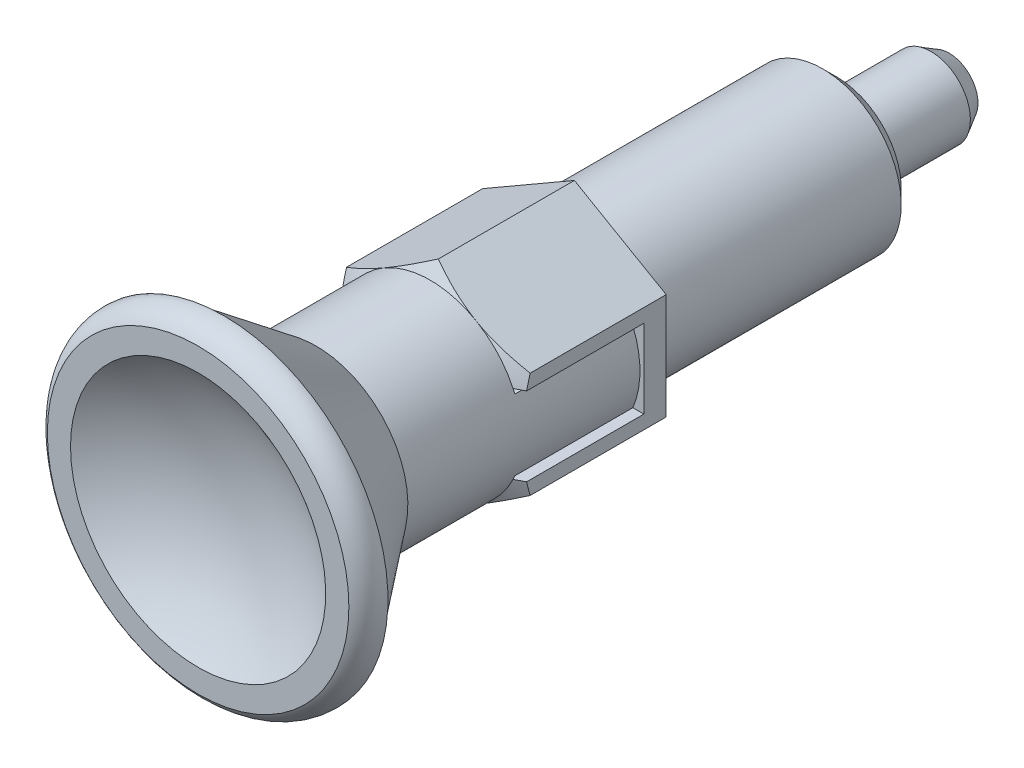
ISO-10303-21;
HEADER;
FILE_DESCRIPTION(('STEP AP214'),'2;1');
FILE_NAME('part.step','',(''),(''),'','','');
FILE_SCHEMA(('AUTOMOTIVE_DESIGN { 1 0 10303 214 1 1 1 1 }'));
ENDSEC;
DATA;
#1=APPLICATION_CONTEXT('core data for automotive mechanical design processes');
#2=APPLICATION_PROTOCOL_DEFINITION('international standard','automotive_design',2000,#1);
#3=PRODUCT_CONTEXT('',#1,'mechanical');
#4=PRODUCT('Part','Part','',(#3));
#5=PRODUCT_RELATED_PRODUCT_CATEGORY('part','',(#4));
#6=PRODUCT_DEFINITION_FORMATION('','',#4);
#7=PRODUCT_DEFINITION_CONTEXT('part definition',#1,'design');
#8=PRODUCT_DEFINITION('design','',#6,#7);
#9=PRODUCT_DEFINITION_SHAPE('','',#8);
#10=(LENGTH_UNIT() NAMED_UNIT(*) SI_UNIT(.MILLI.,.METRE.));
#11=(NAMED_UNIT(*) PLANE_ANGLE_UNIT() SI_UNIT($,.RADIAN.));
#12=(NAMED_UNIT(*) SI_UNIT($,.STERADIAN.) SOLID_ANGLE_UNIT());
#13=UNCERTAINTY_MEASURE_WITH_UNIT(LENGTH_MEASURE(1.E-05),#10,'distance_accuracy_value','');
#14=(GEOMETRIC_REPRESENTATION_CONTEXT(3) GLOBAL_UNCERTAINTY_ASSIGNED_CONTEXT((#13)) GLOBAL_UNIT_ASSIGNED_CONTEXT((#10,
#11,#12)) REPRESENTATION_CONTEXT('',''));
#15=CARTESIAN_POINT('',(0.,0.,0.));
#16=DIRECTION('',(0.,0.,1.));
#17=DIRECTION('',(1.,0.,0.));
#18=AXIS2_PLACEMENT_3D('',#15,#16,#17);
#19=CARTESIAN_POINT('',(0.,0.,41.4));
#20=DIRECTION('',(-1.,0.,0.));
#21=DIRECTION('',(0.,1.,0.));
#22=AXIS2_PLACEMENT_3D('',#19,#20,#21);
#23=SPHERICAL_SURFACE('',#22,16.);
#24=CARTESIAN_POINT('',(0.,9.73190628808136,28.7));
#25=CARTESIAN_POINT('',(-0.273421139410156,9.73190824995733,28.7));
#26=CARTESIAN_POINT('',(-0.546810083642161,9.72037876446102,28.7));
#27=CARTESIAN_POINT('',(-1.09173602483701,9.67434130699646,28.7));
#28=CARTESIAN_POINT('',(-1.36327251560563,9.63982728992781,28.7));
#29=CARTESIAN_POINT('',(-1.90275798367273,9.54800856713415,28.7));
#30=CARTESIAN_POINT('',(-2.17070282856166,9.49067960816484,28.7));
#31=CARTESIAN_POINT('',(-2.70081243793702,9.35363887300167,28.7));
#32=CARTESIAN_POINT('',(-2.96297710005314,9.2739267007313,28.7));
#33=CARTESIAN_POINT('',(-3.47952585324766,9.09273210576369,28.7));
#34=CARTESIAN_POINT('',(-3.73391373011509,8.99126047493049,28.7));
#35=CARTESIAN_POINT('',(-4.23323988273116,8.76724349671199,28.7));
#36=CARTESIAN_POINT('',(-4.4781780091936,8.64469781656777,28.7));
#37=CARTESIAN_POINT('',(-4.9567994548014,8.3794379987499,28.7));
#38=CARTESIAN_POINT('',(-5.19048552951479,8.23672883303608,28.7));
#39=CARTESIAN_POINT('',(-5.64500156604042,7.93213690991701,28.7));
#40=CARTESIAN_POINT('',(-5.86583180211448,7.77025456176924,28.7));
#41=CARTESIAN_POINT('',(-6.29309658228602,7.42844474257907,28.7));
#42=CARTESIAN_POINT('',(-6.49952946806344,7.2485151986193,28.7));
#43=CARTESIAN_POINT('',(-6.89650428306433,6.8719054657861,28.7));
#44=CARTESIAN_POINT('',(-7.0870461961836,6.67522525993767,28.7));
#45=CARTESIAN_POINT('',(-7.45089134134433,6.26650461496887,28.7));
#46=CARTESIAN_POINT('',(-7.62419390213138,6.05446357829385,28.7));
#47=CARTESIAN_POINT('',(-7.95231974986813,5.61653562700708,28.7));
#48=CARTESIAN_POINT('',(-8.10714304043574,5.39064871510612,28.7));
#49=CARTESIAN_POINT('',(-8.39720695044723,4.92663927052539,28.7));
#50=CARTESIAN_POINT('',(-8.53244793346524,4.68851696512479,28.7));
#51=CARTESIAN_POINT('',(-8.78238916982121,4.20172578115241,28.7));
#52=CARTESIAN_POINT('',(-8.89708942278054,3.95305690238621,28.7));
#53=CARTESIAN_POINT('',(-9.10513353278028,3.44694097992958,28.7));
#54=CARTESIAN_POINT('',(-9.19847743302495,3.18949395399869,28.7));
#55=CARTESIAN_POINT('',(-9.36314551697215,2.6676515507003,28.7));
#56=CARTESIAN_POINT('',(-9.43446970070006,2.4032561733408,28.7));
#57=CARTESIAN_POINT('',(-9.55459139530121,1.86939624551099,28.7));
#58=CARTESIAN_POINT('',(-9.60338886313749,1.59993168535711,28.7));
#59=CARTESIAN_POINT('',(-9.67811000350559,1.05784961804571,28.7));
#60=CARTESIAN_POINT('',(-9.70403367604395,0.785232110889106,28.7));
#61=CARTESIAN_POINT('',(-9.73282289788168,0.238782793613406,28.7));
#62=CARTESIAN_POINT('',(-9.73568848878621,-0.0350490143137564,28.7));
#63=CARTESIAN_POINT('',(-9.71834128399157,-0.58198064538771,28.7));
#64=CARTESIAN_POINT('',(-9.69812848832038,-0.855080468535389,28.7));
#65=CARTESIAN_POINT('',(-9.63476819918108,-1.39860665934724,28.7));
#66=CARTESIAN_POINT('',(-9.59162069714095,-1.66903302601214,28.7));
#67=CARTESIAN_POINT('',(-9.48269774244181,-2.20528963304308,28.7));
#68=CARTESIAN_POINT('',(-9.41692228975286,-2.47111987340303,28.7));
#69=CARTESIAN_POINT('',(-9.26321097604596,-2.99629461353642,28.7));
#70=CARTESIAN_POINT('',(-9.17527509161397,-3.25563910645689,28.7));
#71=CARTESIAN_POINT('',(-8.97786812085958,-3.76599827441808,28.7));
#72=CARTESIAN_POINT('',(-8.86839703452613,-4.01701294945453,28.7));
#73=CARTESIAN_POINT('',(-8.62869797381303,-4.50892783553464,28.7));
#74=CARTESIAN_POINT('',(-8.49847000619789,-4.74982804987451,28.7));
#75=CARTESIAN_POINT('',(-8.21818300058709,-5.2198014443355,28.7));
#76=CARTESIAN_POINT('',(-8.06812396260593,-5.44887462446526,28.7));
#77=CARTESIAN_POINT('',(-7.74924171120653,-5.8935652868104,28.7));
#78=CARTESIAN_POINT('',(-7.58041850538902,-6.10918277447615,28.7));
#79=CARTESIAN_POINT('',(-7.22520810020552,-6.5254292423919,28.7));
#80=CARTESIAN_POINT('',(-7.03882090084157,-6.72605822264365,28.7));
#81=CARTESIAN_POINT('',(-6.64980758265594,-7.11090135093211,28.7));
#82=CARTESIAN_POINT('',(-6.44718146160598,-7.2951154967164,28.7));
#83=CARTESIAN_POINT('',(-6.02713087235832,-7.64581927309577,28.7));
#84=CARTESIAN_POINT('',(-5.8097064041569,-7.81230890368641,28.7));
#85=CARTESIAN_POINT('',(-5.36160484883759,-8.12638002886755,28.7));
#86=CARTESIAN_POINT('',(-5.1309277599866,-8.27396152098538,28.7));
#87=CARTESIAN_POINT('',(-4.65796096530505,-8.54916712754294,28.7));
#88=CARTESIAN_POINT('',(-4.41567125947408,-8.67679124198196,28.7));
#89=CARTESIAN_POINT('',(-3.92120177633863,-8.91117475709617,28.7));
#90=CARTESIAN_POINT('',(-3.66902199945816,-9.01793415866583,28.7));
#91=CARTESIAN_POINT('',(-3.15656521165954,-9.20982925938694,28.7));
#92=CARTESIAN_POINT('',(-2.89628820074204,-9.29496495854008,28.7));
#93=CARTESIAN_POINT('',(-2.36948737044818,-9.44300738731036,28.7));
#94=CARTESIAN_POINT('',(-2.10296355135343,-9.50591411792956,28.7));
#95=CARTESIAN_POINT('',(-1.56556391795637,-9.60905138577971,28.7));
#96=CARTESIAN_POINT('',(-1.29468810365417,-9.64928192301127,28.7));
#97=CARTESIAN_POINT('',(-0.750510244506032,-9.70678078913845,28.7));
#98=CARTESIAN_POINT('',(-0.477208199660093,-9.72404911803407,28.7));
#99=CARTESIAN_POINT('',(0.0698791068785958,-9.73550079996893,28.7));
#100=CARTESIAN_POINT('',(0.343664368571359,-9.72968415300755,28.7));
#101=CARTESIAN_POINT('',(0.889771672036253,-9.69500723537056,28.7));
#102=CARTESIAN_POINT('',(1.16209371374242,-9.66614696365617,28.7));
#103=CARTESIAN_POINT('',(1.70333851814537,-9.58558797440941,28.7));
#104=CARTESIAN_POINT('',(1.97226128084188,-9.53388925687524,28.7));
#105=CARTESIAN_POINT('',(2.50479565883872,-9.40802092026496,28.7));
#106=CARTESIAN_POINT('',(2.76840727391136,-9.33385130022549,28.7));
#107=CARTESIAN_POINT('',(3.28844522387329,-9.16356846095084,28.7));
#108=CARTESIAN_POINT('',(3.54487155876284,-9.06745524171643,28.7));
#109=CARTESIAN_POINT('',(4.04871587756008,-8.85396852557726,28.7));
#110=CARTESIAN_POINT('',(4.29613386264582,-8.73659503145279,28.7));
#111=CARTESIAN_POINT('',(4.78020252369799,-8.48142221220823,28.7));
#112=CARTESIAN_POINT('',(5.01685319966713,-8.34362288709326,28.7));
#113=CARTESIAN_POINT('',(5.47770476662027,-8.04857809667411,28.7));
#114=CARTESIAN_POINT('',(5.70190565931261,-7.89133263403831,28.7));
#115=CARTESIAN_POINT('',(6.13626376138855,-7.55851347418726,28.7));
#116=CARTESIAN_POINT('',(6.34642097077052,-7.38293977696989,28.7));
#117=CARTESIAN_POINT('',(6.75119769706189,-7.01471229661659,28.7));
#118=CARTESIAN_POINT('',(6.94581720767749,-6.82205850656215,28.7));
#119=CARTESIAN_POINT('',(7.31813481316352,-6.42104055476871,28.7));
#120=CARTESIAN_POINT('',(7.49583290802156,-6.21267639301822,28.7));
#121=CARTESIAN_POINT('',(7.83304440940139,-5.781718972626,28.7));
#122=CARTESIAN_POINT('',(7.99255780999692,-5.55912570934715,28.7));
#123=CARTESIAN_POINT('',(8.29226580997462,-5.10129265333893,28.7));
#124=CARTESIAN_POINT('',(8.4324604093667,-4.86605286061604,28.7));
#125=CARTESIAN_POINT('',(8.69253396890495,-4.38459941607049,28.7));
#126=CARTESIAN_POINT('',(8.81241295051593,-4.13838577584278,28.7));
#127=CARTESIAN_POINT('',(9.03100318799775,-3.63673483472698,28.7));
#128=CARTESIAN_POINT('',(9.12971444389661,-3.3812975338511,28.7));
#129=CARTESIAN_POINT('',(9.30526742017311,-2.86301537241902,28.7));
#130=CARTESIAN_POINT('',(9.38210914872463,-2.60017051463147,28.7));
#131=CARTESIAN_POINT('',(9.51337682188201,-2.06894181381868,28.7));
#132=CARTESIAN_POINT('',(9.56780276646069,-1.8005579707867,28.7));
#133=CARTESIAN_POINT('',(9.65385201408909,-1.26015885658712,28.7));
#134=CARTESIAN_POINT('',(9.6854752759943,-0.988143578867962,28.7));
#135=CARTESIAN_POINT('',(9.72569417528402,-0.442415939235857,28.7));
#136=CARTESIAN_POINT('',(9.73428981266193,-0.168703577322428,28.7));
#137=CARTESIAN_POINT('',(9.72839235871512,0.378471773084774,28.7));
#138=CARTESIAN_POINT('',(9.71389931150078,0.651934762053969,28.7));
#139=CARTESIAN_POINT('',(9.66192760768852,1.19666773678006,28.7));
#140=CARTESIAN_POINT('',(9.62444895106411,1.46793772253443,28.7));
#141=CARTESIAN_POINT('',(9.5267723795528,2.0063566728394,28.7));
#142=CARTESIAN_POINT('',(9.46657441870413,2.27350562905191,28.7));
#143=CARTESIAN_POINT('',(9.3238872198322,2.80178267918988,28.7));
#144=CARTESIAN_POINT('',(9.24139798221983,3.06291077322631,28.7));
#145=CARTESIAN_POINT('',(9.05471294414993,3.57729441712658,28.7));
#146=CARTESIAN_POINT('',(8.95051674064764,3.83054982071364,28.7));
#147=CARTESIAN_POINT('',(8.72115947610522,4.32738249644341,28.7));
#148=CARTESIAN_POINT('',(8.59599841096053,4.5709597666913,28.7));
#149=CARTESIAN_POINT('',(8.32560656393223,5.04669509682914,28.7));
#150=CARTESIAN_POINT('',(8.18037656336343,5.27885360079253,28.7));
#151=CARTESIAN_POINT('',(7.87087575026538,5.73011089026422,28.7));
#152=CARTESIAN_POINT('',(7.70660495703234,5.94920968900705,28.7));
#153=CARTESIAN_POINT('',(7.36021019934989,6.37276584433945,28.7));
#154=CARTESIAN_POINT('',(7.17808828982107,6.57722488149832,28.7));
#155=CARTESIAN_POINT('',(6.7972658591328,6.97008025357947,28.7));
#156=CARTESIAN_POINT('',(6.59856498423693,7.15847624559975,28.7));
#157=CARTESIAN_POINT('',(6.18594941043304,7.51790585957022,28.7));
#158=CARTESIAN_POINT('',(5.97203097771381,7.68893519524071,28.7));
#159=CARTESIAN_POINT('',(5.53054854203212,8.0123597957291,28.7));
#160=CARTESIAN_POINT('',(5.30298475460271,8.1647553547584,28.7));
#161=CARTESIAN_POINT('',(4.83571056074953,8.44990255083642,28.7));
#162=CARTESIAN_POINT('',(4.59599419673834,8.58264442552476,28.7));
#163=CARTESIAN_POINT('',(4.10623086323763,8.8274468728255,28.7));
#164=CARTESIAN_POINT('',(3.85618407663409,8.93950781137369,28.7));
#165=CARTESIAN_POINT('',(3.34780095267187,9.14204631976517,28.7));
#166=CARTESIAN_POINT('',(3.08947372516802,9.23254674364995,28.7));
#167=CARTESIAN_POINT('',(2.5662024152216,9.39145195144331,28.7));
#168=CARTESIAN_POINT('',(2.30126009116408,9.45986254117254,28.7));
#169=CARTESIAN_POINT('',(1.69995282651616,9.58836325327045,28.7));
#170=CARTESIAN_POINT('',(1.36222155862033,9.64214620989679,28.7));
#171=CARTESIAN_POINT('',(0.682976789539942,9.71391650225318,28.7));
#172=CARTESIAN_POINT('',(0.341463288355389,9.73190383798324,28.7));
#173=CARTESIAN_POINT('',(0.,9.73190628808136,28.7));
#174=B_SPLINE_CURVE_WITH_KNOTS('',3,(#24,#25,#26,#27,#28,#29,#30,#31,#32,#33,#34,#35,#36,#37,
#38,#39,#40,#41,#42,#43,#44,#45,#46,#47,#48,#49,#50,#51,#52,#53,#54,#55,#56,#57,#58,#59,#60,#61,
#62,#63,#64,#65,#66,#67,#68,#69,#70,#71,#72,#73,#74,#75,#76,#77,#78,#79,#80,#81,#82,#83,#84,#85,
#86,#87,#88,#89,#90,#91,#92,#93,#94,#95,#96,#97,#98,#99,#100,#101,#102,#103,#104,#105,#106,#107,
#108,#109,#110,#111,#112,#113,#114,#115,#116,#117,#118,#119,#120,#121,#122,#123,#124,#125,#126,
#127,#128,#129,#130,#131,#132,#133,#134,#135,#136,#137,#138,#139,#140,#141,#142,#143,#144,#145,
#146,#147,#148,#149,#150,#151,#152,#153,#154,#155,#156,#157,#158,#159,#160,#161,#162,#163,#164,
#165,#166,#167,#168,#169,#170,#171,#172,#173),.UNSPECIFIED.,.T.,.F.,(4,2,2,2,2,2,2,2,2,2,2,2,2,
2,2,2,2,2,2,2,2,2,2,2,2,2,2,2,2,2,2,2,2,2,2,2,2,2,2,2,2,2,2,2,2,2,2,2,2,2,2,2,2,2,2,2,2,2,2,2,2,
2,2,2,2,2,2,2,2,2,2,2,2,2,4),(0.,0.819965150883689,1.6401460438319,2.46120116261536,
3.28227081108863,4.10293417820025,4.92361050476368,5.74408481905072,6.56454162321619,
7.38509277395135,8.20564475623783,9.02622867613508,9.84681243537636,10.6673809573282,
11.4879494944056,12.3085163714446,13.1290832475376,13.949651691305,14.7702201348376,
15.590787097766,16.4113540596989,17.2319213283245,18.0524885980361,18.8730567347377,
19.6936248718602,20.5141927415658,21.3347606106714,22.1553281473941,22.9758956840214,
23.796463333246,24.6170309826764,25.4375987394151,26.2581664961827,27.0787342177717,
27.8993019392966,28.7198696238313,29.540437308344,30.3610049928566,31.1815726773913,
32.0021403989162,32.8227081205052,33.6432758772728,34.4638436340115,35.2844112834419,
36.1049789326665,36.9255464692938,37.7461140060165,38.5666818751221,39.3872497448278,
40.2078178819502,41.0283860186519,41.8489532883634,42.669520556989,43.4900875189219,
44.3106544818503,45.1312229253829,45.9517913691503,46.7723582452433,47.5929251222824,
48.4134936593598,49.2340621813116,50.0546459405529,50.8752298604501,51.6957818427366,
52.5163329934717,53.3367897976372,54.1572641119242,54.9779404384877,55.7986038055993,
56.6196734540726,57.440728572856,58.2609094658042,59.0808746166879,60.1048919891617,
61.1289093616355),.UNSPECIFIED.);
#175=CARTESIAN_POINT('',(0.,9.73190628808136,28.7));
#176=VERTEX_POINT('',#175);
#177=EDGE_CURVE('E19',#176,#176,#174,.T.);
#178=ORIENTED_EDGE('',*,*,#177,.T.);
#179=EDGE_LOOP('',(#178));
#180=FACE_BOUND('',#179,.T.);
#181=ADVANCED_FACE('F14',(#180),#23,.F.);
#182=CARTESIAN_POINT('',(9.73190628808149,0.,28.7));
#183=DIRECTION('',(0.,0.,-1.));
#184=DIRECTION('',(0.,1.,0.));
#185=AXIS2_PLACEMENT_3D('',#182,#183,#184);
#186=PLANE('',#185);
#187=ORIENTED_EDGE('',*,*,#177,.F.);
#188=EDGE_LOOP('',(#187));
#189=FACE_BOUND('',#188,.T.);
#190=CARTESIAN_POINT('',(0.,0.,28.7));
#191=DIRECTION('',(0.,0.,-1.));
#192=DIRECTION('',(0.,1.,0.));
#193=AXIS2_PLACEMENT_3D('',#190,#191,#192);
#194=CIRCLE('',#193,11.5);
#195=CARTESIAN_POINT('',(0.,11.5,28.7));
#196=VERTEX_POINT('',#195);
#197=EDGE_CURVE('E262',#196,#196,#194,.T.);
#198=ORIENTED_EDGE('',*,*,#197,.F.);
#199=EDGE_LOOP('',(#198));
#200=FACE_BOUND('',#199,.T.);
#201=ADVANCED_FACE('F273',(#189,#200),#186,.F.);
#202=CARTESIAN_POINT('',(0.,0.,26.9596620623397));
#203=DIRECTION('',(0.,0.,-1.));
#204=DIRECTION('',(0.,1.,0.));
#205=AXIS2_PLACEMENT_3D('',#202,#203,#204);
#206=TOROIDAL_SURFACE('',#205,10.5144930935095,2.);
#207=CARTESIAN_POINT('',(0.,0.,26.7193241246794));
#208=DIRECTION('',(0.,0.,1.));
#209=DIRECTION('',(0.,-1.,0.));
#210=AXIS2_PLACEMENT_3D('',#207,#208,#209);
#211=CIRCLE('',#210,12.5);
#212=CARTESIAN_POINT('',(0.,-12.5,26.7193241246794));
#213=VERTEX_POINT('',#212);
#214=EDGE_CURVE('E241',#213,#213,#211,.T.);
#215=ORIENTED_EDGE('',*,*,#214,.T.);
#216=EDGE_LOOP('',(#215));
#217=FACE_BOUND('',#216,.T.);
#218=ORIENTED_EDGE('',*,*,#197,.T.);
#219=EDGE_LOOP('',(#218));
#220=FACE_BOUND('',#219,.T.);
#221=ADVANCED_FACE('F269',(#217,#220),#206,.T.);
#222=CARTESIAN_POINT('',(0.,0.,-29.));
#223=DIRECTION('',(0.,0.,1.));
#224=DIRECTION('',(0.,-1.,0.));
#225=AXIS2_PLACEMENT_3D('',#222,#223,#224);
#226=CYLINDRICAL_SURFACE('',#225,12.5);
#227=ORIENTED_EDGE('',*,*,#214,.F.);
#228=EDGE_LOOP('',(#227));
#229=FACE_BOUND('',#228,.T.);
#230=CARTESIAN_POINT('',(0.,0.,26.8937013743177));
#231=DIRECTION('',(0.,0.,1.));
#232=DIRECTION('',(0.,-1.,0.));
#233=AXIS2_PLACEMENT_3D('',#230,#231,#232);
#234=CIRCLE('',#233,12.5);
#235=CARTESIAN_POINT('',(0.,-12.5,26.8937013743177));
#236=VERTEX_POINT('',#235);
#237=EDGE_CURVE('E235',#236,#236,#234,.F.);
#238=ORIENTED_EDGE('',*,*,#237,.F.);
#239=EDGE_LOOP('',(#238));
#240=FACE_BOUND('',#239,.T.);
#241=ADVANCED_FACE('F272',(#229,#240),#226,.F.);
#242=CARTESIAN_POINT('',(0.,0.,26.8937013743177));
#243=DIRECTION('',(0.,0.,1.));
#244=DIRECTION('',(-1.,0.,0.));
#245=AXIS2_PLACEMENT_3D('',#242,#243,#244);
#246=CONICAL_SURFACE('',#245,12.5,0.65275314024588);
#247=ORIENTED_EDGE('',*,*,#237,.T.);
#248=EDGE_LOOP('',(#247));
#249=FACE_BOUND('',#248,.T.);
#250=CARTESIAN_POINT('',(0.,0.,19.7));
#251=DIRECTION('',(0.,0.,1.));
#252=DIRECTION('',(0.,-1.,0.));
#253=AXIS2_PLACEMENT_3D('',#250,#251,#252);
#254=CIRCLE('',#253,7.);
#255=CARTESIAN_POINT('',(0.,-7.,19.7));
#256=VERTEX_POINT('',#255);
#257=EDGE_CURVE('E216',#256,#256,#254,.F.);
#258=ORIENTED_EDGE('',*,*,#257,.F.);
#259=EDGE_LOOP('',(#258));
#260=FACE_BOUND('',#259,.T.);
#261=ADVANCED_FACE('F541',(#249,#260),#246,.T.);
#262=CARTESIAN_POINT('',(-8.,-2.7,2.));
#263=DIRECTION('',(0.,1.,0.));
#264=DIRECTION('',(0.,0.,1.));
#265=AXIS2_PLACEMENT_3D('',#262,#263,#264);
#266=PLANE('',#265);
#267=DIRECTION('',(0.,0.,1.));
#268=VECTOR('',#267,1.);
#269=CARTESIAN_POINT('',(-4.1,-2.7,11.));
#270=LINE('',#269,#268);
#271=CARTESIAN_POINT('',(-4.1,-2.7,2.));
#272=VERTEX_POINT('',#271);
#273=CARTESIAN_POINT('',(-4.1,-2.7,11.));
#274=VERTEX_POINT('',#273);
#275=EDGE_CURVE('E194',#272,#274,#270,.T.);
#276=ORIENTED_EDGE('',*,*,#275,.T.);
#277=DIRECTION('',(1.,0.,0.));
#278=VECTOR('',#277,1.);
#279=CARTESIAN_POINT('',(-8.,-2.7,11.));
#280=LINE('',#279,#278);
#281=CARTESIAN_POINT('',(-6.458327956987,-2.7,11.));
#282=VERTEX_POINT('',#281);
#283=EDGE_CURVE('E187',#274,#282,#280,.F.);
#284=ORIENTED_EDGE('',*,*,#283,.T.);
#285=DIRECTION('',(0.,0.,1.));
#286=VECTOR('',#285,1.);
#287=CARTESIAN_POINT('',(-6.458327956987,-2.7,-29.));
#288=LINE('',#287,#286);
#289=CARTESIAN_POINT('',(-6.458327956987,-2.7,2.));
#290=VERTEX_POINT('',#289);
#291=EDGE_CURVE('E191',#290,#282,#288,.T.);
#292=ORIENTED_EDGE('',*,*,#291,.F.);
#293=DIRECTION('',(1.,0.,0.));
#294=VECTOR('',#293,1.);
#295=CARTESIAN_POINT('',(-8.,-2.7,2.));
#296=LINE('',#295,#294);
#297=EDGE_CURVE('E232',#290,#272,#296,.T.);
#298=ORIENTED_EDGE('',*,*,#297,.T.);
#299=EDGE_LOOP('',(#276,#284,#292,#298));
#300=FACE_BOUND('',#299,.T.);
#301=ADVANCED_FACE('F189',(#300),#266,.F.);
#302=CARTESIAN_POINT('',(8.,-2.7,2.));
#303=DIRECTION('',(0.,-1.,0.));
#304=DIRECTION('',(0.,0.,-1.));
#305=AXIS2_PLACEMENT_3D('',#302,#303,#304);
#306=PLANE('',#305);
#307=DIRECTION('',(0.,0.,1.));
#308=VECTOR('',#307,1.);
#309=CARTESIAN_POINT('',(4.1,-2.7,11.));
#310=LINE('',#309,#308);
#311=CARTESIAN_POINT('',(4.1,-2.7,2.));
#312=VERTEX_POINT('',#311);
#313=CARTESIAN_POINT('',(4.1,-2.7,11.));
#314=VERTEX_POINT('',#313);
#315=EDGE_CURVE('E255',#312,#314,#310,.T.);
#316=ORIENTED_EDGE('',*,*,#315,.F.);
#317=DIRECTION('',(1.,0.,0.));
#318=VECTOR('',#317,1.);
#319=CARTESIAN_POINT('',(8.,-2.7,2.));
#320=LINE('',#319,#318);
#321=CARTESIAN_POINT('',(6.458327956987,-2.7,2.));
#322=VERTEX_POINT('',#321);
#323=EDGE_CURVE('E233',#322,#312,#320,.F.);
#324=ORIENTED_EDGE('',*,*,#323,.F.);
#325=DIRECTION('',(0.,0.,1.));
#326=VECTOR('',#325,1.);
#327=CARTESIAN_POINT('',(6.458327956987,-2.7,-29.));
#328=LINE('',#327,#326);
#329=CARTESIAN_POINT('',(6.458327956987,-2.7,11.));
#330=VERTEX_POINT('',#329);
#331=EDGE_CURVE('E236',#330,#322,#328,.F.);
#332=ORIENTED_EDGE('',*,*,#331,.F.);
#333=DIRECTION('',(1.,0.,0.));
#334=VECTOR('',#333,1.);
#335=CARTESIAN_POINT('',(8.,-2.7,11.));
#336=LINE('',#335,#334);
#337=EDGE_CURVE('E500',#314,#330,#336,.T.);
#338=ORIENTED_EDGE('',*,*,#337,.F.);
#339=EDGE_LOOP('',(#316,#324,#332,#338));
#340=FACE_BOUND('',#339,.T.);
#341=ADVANCED_FACE('F535',(#340),#306,.T.);
#342=CARTESIAN_POINT('',(8.,2.7,2.));
#343=DIRECTION('',(0.,0.,-1.));
#344=DIRECTION('',(0.,1.,0.));
#345=AXIS2_PLACEMENT_3D('',#342,#343,#344);
#346=PLANE('',#345);
#347=DIRECTION('',(0.,1.,0.));
#348=VECTOR('',#347,1.);
#349=CARTESIAN_POINT('',(4.1,0.,2.));
#350=LINE('',#349,#348);
#351=CARTESIAN_POINT('',(4.1,2.7,2.));
#352=VERTEX_POINT('',#351);
#353=EDGE_CURVE('E253',#352,#312,#350,.F.);
#354=ORIENTED_EDGE('',*,*,#353,.F.);
#355=DIRECTION('',(-1.,0.,0.));
#356=VECTOR('',#355,1.);
#357=CARTESIAN_POINT('',(8.,2.7,2.));
#358=LINE('',#357,#356);
#359=CARTESIAN_POINT('',(6.458327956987,2.7,2.));
#360=VERTEX_POINT('',#359);
#361=EDGE_CURVE('E230',#360,#352,#358,.T.);
#362=ORIENTED_EDGE('',*,*,#361,.F.);
#363=CARTESIAN_POINT('',(0.,0.,2.));
#364=DIRECTION('',(0.,0.,1.));
#365=DIRECTION('',(0.,-1.,0.));
#366=AXIS2_PLACEMENT_3D('',#363,#364,#365);
#367=CIRCLE('',#366,7.);
#368=EDGE_CURVE('E229',#322,#360,#367,.T.);
#369=ORIENTED_EDGE('',*,*,#368,.F.);
#370=ORIENTED_EDGE('',*,*,#323,.T.);
#371=EDGE_LOOP('',(#354,#362,#369,#370));
#372=FACE_BOUND('',#371,.T.);
#373=ADVANCED_FACE('F531',(#372),#346,.T.);
#374=CARTESIAN_POINT('',(8.,2.7,11.));
#375=DIRECTION('',(0.,1.,0.));
#376=DIRECTION('',(-1.,0.,0.));
#377=AXIS2_PLACEMENT_3D('',#374,#375,#376);
#378=PLANE('',#377);
#379=DIRECTION('',(0.,0.,1.));
#380=VECTOR('',#379,1.);
#381=CARTESIAN_POINT('',(4.1,2.7,11.));
#382=LINE('',#381,#380);
#383=CARTESIAN_POINT('',(4.1,2.7,11.));
#384=VERTEX_POINT('',#383);
#385=EDGE_CURVE('E250',#384,#352,#382,.F.);
#386=ORIENTED_EDGE('',*,*,#385,.F.);
#387=DIRECTION('',(1.,0.,0.));
#388=VECTOR('',#387,1.);
#389=CARTESIAN_POINT('',(8.,2.7,11.));
#390=LINE('',#389,#388);
#391=CARTESIAN_POINT('',(6.458327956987,2.7,11.));
#392=VERTEX_POINT('',#391);
#393=EDGE_CURVE('E502',#392,#384,#390,.F.);
#394=ORIENTED_EDGE('',*,*,#393,.F.);
#395=DIRECTION('',(0.,0.,1.));
#396=VECTOR('',#395,1.);
#397=CARTESIAN_POINT('',(6.458327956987,2.7,-29.));
#398=LINE('',#397,#396);
#399=EDGE_CURVE('E225',#360,#392,#398,.T.);
#400=ORIENTED_EDGE('',*,*,#399,.F.);
#401=ORIENTED_EDGE('',*,*,#361,.T.);
#402=EDGE_LOOP('',(#386,#394,#400,#401));
#403=FACE_BOUND('',#402,.T.);
#404=ADVANCED_FACE('F527',(#403),#378,.T.);
#405=CARTESIAN_POINT('',(-8.,2.7,11.));
#406=DIRECTION('',(0.,-1.,0.));
#407=DIRECTION('',(1.,0.,0.));
#408=AXIS2_PLACEMENT_3D('',#405,#406,#407);
#409=PLANE('',#408);
#410=DIRECTION('',(0.,0.,1.));
#411=VECTOR('',#410,1.);
#412=CARTESIAN_POINT('',(-4.1,2.7,11.));
#413=LINE('',#412,#411);
#414=CARTESIAN_POINT('',(-4.1,2.7,11.));
#415=VERTEX_POINT('',#414);
#416=CARTESIAN_POINT('',(-4.1,2.7,2.));
#417=VERTEX_POINT('',#416);
#418=EDGE_CURVE('E248',#415,#417,#413,.F.);
#419=ORIENTED_EDGE('',*,*,#418,.T.);
#420=DIRECTION('',(1.,0.,0.));
#421=VECTOR('',#420,1.);
#422=CARTESIAN_POINT('',(-8.,2.7,2.));
#423=LINE('',#422,#421);
#424=CARTESIAN_POINT('',(-6.458327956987,2.7,2.));
#425=VERTEX_POINT('',#424);
#426=EDGE_CURVE('E507',#417,#425,#423,.F.);
#427=ORIENTED_EDGE('',*,*,#426,.T.);
#428=DIRECTION('',(0.,0.,1.));
#429=VECTOR('',#428,1.);
#430=CARTESIAN_POINT('',(-6.458327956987,2.7,-29.));
#431=LINE('',#430,#429);
#432=CARTESIAN_POINT('',(-6.458327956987,2.7,11.));
#433=VERTEX_POINT('',#432);
#434=EDGE_CURVE('E223',#433,#425,#431,.F.);
#435=ORIENTED_EDGE('',*,*,#434,.F.);
#436=DIRECTION('',(1.,0.,0.));
#437=VECTOR('',#436,1.);
#438=CARTESIAN_POINT('',(-8.,2.7,11.));
#439=LINE('',#438,#437);
#440=EDGE_CURVE('E198',#433,#415,#439,.T.);
#441=ORIENTED_EDGE('',*,*,#440,.T.);
#442=EDGE_LOOP('',(#419,#427,#435,#441));
#443=FACE_BOUND('',#442,.T.);
#444=ADVANCED_FACE('F523',(#443),#409,.F.);
#445=CARTESIAN_POINT('',(-8.,2.7,2.));
#446=DIRECTION('',(0.,0.,1.));
#447=DIRECTION('',(0.,-1.,0.));
#448=AXIS2_PLACEMENT_3D('',#445,#446,#447);
#449=PLANE('',#448);
#450=DIRECTION('',(0.,1.,0.));
#451=VECTOR('',#450,1.);
#452=CARTESIAN_POINT('',(-4.1,0.,2.));
#453=LINE('',#452,#451);
#454=EDGE_CURVE('E245',#417,#272,#453,.F.);
#455=ORIENTED_EDGE('',*,*,#454,.T.);
#456=ORIENTED_EDGE('',*,*,#297,.F.);
#457=CARTESIAN_POINT('',(0.,0.,2.));
#458=DIRECTION('',(0.,0.,1.));
#459=DIRECTION('',(0.,-1.,0.));
#460=AXIS2_PLACEMENT_3D('',#457,#458,#459);
#461=CIRCLE('',#460,7.);
#462=EDGE_CURVE('E215',#425,#290,#461,.T.);
#463=ORIENTED_EDGE('',*,*,#462,.F.);
#464=ORIENTED_EDGE('',*,*,#426,.F.);
#465=EDGE_LOOP('',(#455,#456,#463,#464));
#466=FACE_BOUND('',#465,.T.);
#467=ADVANCED_FACE('F518',(#466),#449,.F.);
#468=CARTESIAN_POINT('',(0.,0.,-23.));
#469=DIRECTION('',(-1.,0.,0.));
#470=DIRECTION('',(0.,1.,0.));
#471=AXIS2_PLACEMENT_3D('',#468,#469,#470);
#472=SPHERICAL_SURFACE('',#471,5.99999999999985);
#473=CARTESIAN_POINT('',(0.,0.,-28.5810746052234));
#474=DIRECTION('',(0.,0.,1.));
#475=DIRECTION('',(0.,-1.,0.));
#476=AXIS2_PLACEMENT_3D('',#473,#474,#475);
#477=CIRCLE('',#476,2.20263620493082);
#478=CARTESIAN_POINT('',(0.,-2.20263620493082,-28.5810746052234));
#479=VERTEX_POINT('',#478);
#480=EDGE_CURVE('E505',#479,#479,#477,.T.);
#481=ORIENTED_EDGE('',*,*,#480,.F.);
#482=EDGE_LOOP('',(#481));
#483=FACE_BOUND('',#482,.T.);
#484=ADVANCED_FACE('F513',(#483),#472,.T.);
#485=CARTESIAN_POINT('',(8.,3.,11.));
#486=DIRECTION('',(0.,0.,-1.));
#487=DIRECTION('',(0.,1.,0.));
#488=AXIS2_PLACEMENT_3D('',#485,#486,#487);
#489=PLANE('',#488);
#490=DIRECTION('',(0.,1.,0.));
#491=VECTOR('',#490,1.);
#492=CARTESIAN_POINT('',(4.1,0.,11.));
#493=LINE('',#492,#491);
#494=CARTESIAN_POINT('',(4.1,3.,11.));
#495=VERTEX_POINT('',#494);
#496=EDGE_CURVE('E254',#495,#384,#493,.F.);
#497=ORIENTED_EDGE('',*,*,#496,.F.);
#498=DIRECTION('',(-1.,0.,0.));
#499=VECTOR('',#498,1.);
#500=CARTESIAN_POINT('',(12.,3.,11.));
#501=LINE('',#500,#499);
#502=CARTESIAN_POINT('',(6.32455532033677,3.,11.));
#503=VERTEX_POINT('',#502);
#504=EDGE_CURVE('E473',#495,#503,#501,.F.);
#505=ORIENTED_EDGE('',*,*,#504,.T.);
#506=CARTESIAN_POINT('',(0.,0.,11.));
#507=DIRECTION('',(0.,0.,1.));
#508=DIRECTION('',(0.,-1.,0.));
#509=AXIS2_PLACEMENT_3D('',#506,#507,#508);
#510=CIRCLE('',#509,7.);
#511=EDGE_CURVE('E228',#392,#503,#510,.T.);
#512=ORIENTED_EDGE('',*,*,#511,.F.);
#513=ORIENTED_EDGE('',*,*,#393,.T.);
#514=EDGE_LOOP('',(#497,#505,#512,#513));
#515=FACE_BOUND('',#514,.T.);
#516=ADVANCED_FACE('F517',(#515),#489,.T.);
#517=CARTESIAN_POINT('',(8.,-2.7,11.));
#518=DIRECTION('',(0.,0.,-1.));
#519=DIRECTION('',(0.,1.,0.));
#520=AXIS2_PLACEMENT_3D('',#517,#518,#519);
#521=PLANE('',#520);
#522=DIRECTION('',(0.,1.,0.));
#523=VECTOR('',#522,1.);
#524=CARTESIAN_POINT('',(4.1,0.,11.));
#525=LINE('',#524,#523);
#526=CARTESIAN_POINT('',(4.1,-3.,11.));
#527=VERTEX_POINT('',#526);
#528=EDGE_CURVE('E497',#314,#527,#525,.F.);
#529=ORIENTED_EDGE('',*,*,#528,.F.);
#530=ORIENTED_EDGE('',*,*,#337,.T.);
#531=CARTESIAN_POINT('',(0.,0.,11.));
#532=DIRECTION('',(0.,0.,1.));
#533=DIRECTION('',(0.,-1.,0.));
#534=AXIS2_PLACEMENT_3D('',#531,#532,#533);
#535=CIRCLE('',#534,7.);
#536=CARTESIAN_POINT('',(6.32455532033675,-3.,11.));
#537=VERTEX_POINT('',#536);
#538=EDGE_CURVE('E208',#537,#330,#535,.T.);
#539=ORIENTED_EDGE('',*,*,#538,.F.);
#540=DIRECTION('',(1.,0.,0.));
#541=VECTOR('',#540,1.);
#542=CARTESIAN_POINT('',(6.32455532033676,-3.,11.));
#543=LINE('',#542,#541);
#544=EDGE_CURVE('E492',#537,#527,#543,.F.);
#545=ORIENTED_EDGE('',*,*,#544,.T.);
#546=EDGE_LOOP('',(#529,#530,#539,#545));
#547=FACE_BOUND('',#546,.T.);
#548=ADVANCED_FACE('F576',(#547),#521,.T.);
#549=CARTESIAN_POINT('',(4.1,0.,11.));
#550=DIRECTION('',(1.,0.,0.));
#551=DIRECTION('',(0.,1.,0.));
#552=AXIS2_PLACEMENT_3D('',#549,#550,#551);
#553=PLANE('',#552);
#554=ORIENTED_EDGE('',*,*,#353,.T.);
#555=ORIENTED_EDGE('',*,*,#315,.T.);
#556=ORIENTED_EDGE('',*,*,#528,.T.);
#557=DIRECTION('',(0.,0.,1.));
#558=VECTOR('',#557,1.);
#559=CARTESIAN_POINT('',(4.1,-3.,1.7));
#560=LINE('',#559,#558);
#561=CARTESIAN_POINT('',(4.1,-3.,1.7));
#562=VERTEX_POINT('',#561);
#563=EDGE_CURVE('E467',#527,#562,#560,.F.);
#564=ORIENTED_EDGE('',*,*,#563,.T.);
#565=DIRECTION('',(0.,-1.,0.));
#566=VECTOR('',#565,1.);
#567=CARTESIAN_POINT('',(4.1,0.,1.7));
#568=LINE('',#567,#566);
#569=CARTESIAN_POINT('',(4.1,3.,1.7));
#570=VERTEX_POINT('',#569);
#571=EDGE_CURVE('E472',#570,#562,#568,.T.);
#572=ORIENTED_EDGE('',*,*,#571,.F.);
#573=DIRECTION('',(0.,0.,1.));
#574=VECTOR('',#573,1.);
#575=CARTESIAN_POINT('',(4.1,3.,1.7));
#576=LINE('',#575,#574);
#577=EDGE_CURVE('E478',#570,#495,#576,.T.);
#578=ORIENTED_EDGE('',*,*,#577,.T.);
#579=ORIENTED_EDGE('',*,*,#496,.T.);
#580=ORIENTED_EDGE('',*,*,#385,.T.);
#581=EDGE_LOOP('',(#554,#555,#556,#564,#572,#578,#579,#580));
#582=FACE_BOUND('',#581,.T.);
#583=ADVANCED_FACE('F573',(#582),#553,.T.);
#584=CARTESIAN_POINT('',(-8.,3.,11.));
#585=DIRECTION('',(0.,0.,1.));
#586=DIRECTION('',(0.,-1.,0.));
#587=AXIS2_PLACEMENT_3D('',#584,#585,#586);
#588=PLANE('',#587);
#589=DIRECTION('',(0.,1.,0.));
#590=VECTOR('',#589,1.);
#591=CARTESIAN_POINT('',(-4.1,0.,11.));
#592=LINE('',#591,#590);
#593=CARTESIAN_POINT('',(-4.1,3.,11.));
#594=VERTEX_POINT('',#593);
#595=EDGE_CURVE('E197',#594,#415,#592,.F.);
#596=ORIENTED_EDGE('',*,*,#595,.T.);
#597=ORIENTED_EDGE('',*,*,#440,.F.);
#598=CARTESIAN_POINT('',(0.,0.,11.));
#599=DIRECTION('',(0.,0.,1.));
#600=DIRECTION('',(0.,-1.,0.));
#601=AXIS2_PLACEMENT_3D('',#598,#599,#600);
#602=CIRCLE('',#601,7.);
#603=CARTESIAN_POINT('',(-6.32455532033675,3.,11.));
#604=VERTEX_POINT('',#603);
#605=EDGE_CURVE('E605',#604,#433,#602,.T.);
#606=ORIENTED_EDGE('',*,*,#605,.F.);
#607=DIRECTION('',(-1.,0.,0.));
#608=VECTOR('',#607,1.);
#609=CARTESIAN_POINT('',(-6.32455532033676,3.,11.));
#610=LINE('',#609,#608);
#611=EDGE_CURVE('E454',#604,#594,#610,.F.);
#612=ORIENTED_EDGE('',*,*,#611,.T.);
#613=EDGE_LOOP('',(#596,#597,#606,#612));
#614=FACE_BOUND('',#613,.T.);
#615=ADVANCED_FACE('F570',(#614),#588,.F.);
#616=CARTESIAN_POINT('',(-8.,-2.7,11.));
#617=DIRECTION('',(0.,0.,1.));
#618=DIRECTION('',(0.,-1.,0.));
#619=AXIS2_PLACEMENT_3D('',#616,#617,#618);
#620=PLANE('',#619);
#621=DIRECTION('',(0.,1.,0.));
#622=VECTOR('',#621,1.);
#623=CARTESIAN_POINT('',(-4.1,0.,11.));
#624=LINE('',#623,#622);
#625=CARTESIAN_POINT('',(-4.1,-3.,11.));
#626=VERTEX_POINT('',#625);
#627=EDGE_CURVE('E219',#274,#626,#624,.F.);
#628=ORIENTED_EDGE('',*,*,#627,.T.);
#629=DIRECTION('',(1.,0.,0.));
#630=VECTOR('',#629,1.);
#631=CARTESIAN_POINT('',(-12.,-3.,11.));
#632=LINE('',#631,#630);
#633=CARTESIAN_POINT('',(-6.32455532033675,-3.,11.));
#634=VERTEX_POINT('',#633);
#635=EDGE_CURVE('E205',#626,#634,#632,.F.);
#636=ORIENTED_EDGE('',*,*,#635,.T.);
#637=CARTESIAN_POINT('',(0.,0.,11.));
#638=DIRECTION('',(0.,0.,1.));
#639=DIRECTION('',(0.,-1.,0.));
#640=AXIS2_PLACEMENT_3D('',#637,#638,#639);
#641=CIRCLE('',#640,7.);
#642=EDGE_CURVE('E202',#282,#634,#641,.T.);
#643=ORIENTED_EDGE('',*,*,#642,.F.);
#644=ORIENTED_EDGE('',*,*,#283,.F.);
#645=EDGE_LOOP('',(#628,#636,#643,#644));
#646=FACE_BOUND('',#645,.T.);
#647=ADVANCED_FACE('F203',(#646),#620,.F.);
#648=CARTESIAN_POINT('',(-4.1,0.,11.));
#649=DIRECTION('',(1.,0.,0.));
#650=DIRECTION('',(0.,1.,0.));
#651=AXIS2_PLACEMENT_3D('',#648,#649,#650);
#652=PLANE('',#651);
#653=ORIENTED_EDGE('',*,*,#275,.F.);
#654=ORIENTED_EDGE('',*,*,#454,.F.);
#655=ORIENTED_EDGE('',*,*,#418,.F.);
#656=ORIENTED_EDGE('',*,*,#595,.F.);
#657=DIRECTION('',(0.,0.,1.));
#658=VECTOR('',#657,1.);
#659=CARTESIAN_POINT('',(-4.1,3.,1.7));
#660=LINE('',#659,#658);
#661=CARTESIAN_POINT('',(-4.1,3.,1.7));
#662=VERTEX_POINT('',#661);
#663=EDGE_CURVE('E480',#594,#662,#660,.F.);
#664=ORIENTED_EDGE('',*,*,#663,.T.);
#665=DIRECTION('',(0.,-1.,0.));
#666=VECTOR('',#665,1.);
#667=CARTESIAN_POINT('',(-4.1,0.,1.7));
#668=LINE('',#667,#666);
#669=CARTESIAN_POINT('',(-4.1,-3.,1.7));
#670=VERTEX_POINT('',#669);
#671=EDGE_CURVE('E445',#670,#662,#668,.F.);
#672=ORIENTED_EDGE('',*,*,#671,.F.);
#673=DIRECTION('',(0.,0.,1.));
#674=VECTOR('',#673,1.);
#675=CARTESIAN_POINT('',(-4.1,-3.,1.7));
#676=LINE('',#675,#674);
#677=EDGE_CURVE('E482',#670,#626,#676,.T.);
#678=ORIENTED_EDGE('',*,*,#677,.T.);
#679=ORIENTED_EDGE('',*,*,#627,.F.);
#680=EDGE_LOOP('',(#653,#654,#655,#656,#664,#672,#678,#679));
#681=FACE_BOUND('',#680,.T.);
#682=ADVANCED_FACE('F554',(#681),#652,.F.);
#683=CARTESIAN_POINT('',(0.,0.,-29.));
#684=DIRECTION('',(0.,0.,1.));
#685=DIRECTION('',(0.,-1.,0.));
#686=AXIS2_PLACEMENT_3D('',#683,#684,#685);
#687=CYLINDRICAL_SURFACE('',#686,7.);
#688=ORIENTED_EDGE('',*,*,#434,.T.);
#689=ORIENTED_EDGE('',*,*,#462,.T.);
#690=ORIENTED_EDGE('',*,*,#291,.T.);
#691=ORIENTED_EDGE('',*,*,#642,.T.);
#692=CARTESIAN_POINT('',(0.,0.,11.));
#693=DIRECTION('',(0.,0.,-1.));
#694=DIRECTION('',(0.,1.,0.));
#695=AXIS2_PLACEMENT_3D('',#692,#693,#694);
#696=CIRCLE('',#695,7.);
#697=CARTESIAN_POINT('',(-3.5,-6.06217782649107,11.));
#698=VERTEX_POINT('',#697);
#699=EDGE_CURVE('E452',#698,#634,#696,.T.);
#700=ORIENTED_EDGE('',*,*,#699,.F.);
#701=CARTESIAN_POINT('',(0.,0.,11.));
#702=DIRECTION('',(0.,0.,-1.));
#703=DIRECTION('',(0.,1.,0.));
#704=AXIS2_PLACEMENT_3D('',#701,#702,#703);
#705=CIRCLE('',#704,7.);
#706=CARTESIAN_POINT('',(3.5,-6.06217782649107,11.));
#707=VERTEX_POINT('',#706);
#708=EDGE_CURVE('E456',#707,#698,#705,.T.);
#709=ORIENTED_EDGE('',*,*,#708,.F.);
#710=CARTESIAN_POINT('',(0.,0.,11.));
#711=DIRECTION('',(0.,0.,-1.));
#712=DIRECTION('',(0.,1.,0.));
#713=AXIS2_PLACEMENT_3D('',#710,#711,#712);
#714=CIRCLE('',#713,7.);
#715=EDGE_CURVE('E459',#537,#707,#714,.T.);
#716=ORIENTED_EDGE('',*,*,#715,.F.);
#717=ORIENTED_EDGE('',*,*,#538,.T.);
#718=ORIENTED_EDGE('',*,*,#331,.T.);
#719=ORIENTED_EDGE('',*,*,#368,.T.);
#720=ORIENTED_EDGE('',*,*,#399,.T.);
#721=ORIENTED_EDGE('',*,*,#511,.T.);
#722=CARTESIAN_POINT('',(0.,0.,11.));
#723=DIRECTION('',(0.,0.,-1.));
#724=DIRECTION('',(0.,1.,0.));
#725=AXIS2_PLACEMENT_3D('',#722,#723,#724);
#726=CIRCLE('',#725,7.);
#727=CARTESIAN_POINT('',(3.5,6.06217782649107,11.));
#728=VERTEX_POINT('',#727);
#729=EDGE_CURVE('E413',#728,#503,#726,.T.);
#730=ORIENTED_EDGE('',*,*,#729,.F.);
#731=CARTESIAN_POINT('',(0.,0.,11.));
#732=DIRECTION('',(0.,0.,-1.));
#733=DIRECTION('',(0.,1.,0.));
#734=AXIS2_PLACEMENT_3D('',#731,#732,#733);
#735=CIRCLE('',#734,7.);
#736=CARTESIAN_POINT('',(-3.5,6.06217782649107,11.));
#737=VERTEX_POINT('',#736);
#738=EDGE_CURVE('E429',#737,#728,#735,.T.);
#739=ORIENTED_EDGE('',*,*,#738,.F.);
#740=CARTESIAN_POINT('',(0.,0.,11.));
#741=DIRECTION('',(0.,0.,-1.));
#742=DIRECTION('',(0.,1.,0.));
#743=AXIS2_PLACEMENT_3D('',#740,#741,#742);
#744=CIRCLE('',#743,7.);
#745=EDGE_CURVE('E432',#604,#737,#744,.T.);
#746=ORIENTED_EDGE('',*,*,#745,.F.);
#747=ORIENTED_EDGE('',*,*,#605,.T.);
#748=EDGE_LOOP('',(#688,#689,#690,#691,#700,#709,#716,#717,#718,#719,#720,#721,#730,#739,#746,#747));
#749=FACE_BOUND('',#748,.T.);
#750=ORIENTED_EDGE('',*,*,#257,.T.);
#751=EDGE_LOOP('',(#750));
#752=FACE_BOUND('',#751,.T.);
#753=ADVANCED_FACE('F212',(#749,#752),#687,.T.);
#754=CARTESIAN_POINT('',(0.,0.,-27.2000000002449));
#755=DIRECTION('',(0.,0.,1.));
#756=DIRECTION('',(0.,-1.,0.));
#757=AXIS2_PLACEMENT_3D('',#754,#755,#756);
#758=CONICAL_SURFACE('',#757,2.99999999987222,0.523598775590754);
#759=CARTESIAN_POINT('',(0.,0.,-27.2));
#760=DIRECTION('',(0.,0.,1.));
#761=DIRECTION('',(0.,-1.,0.));
#762=AXIS2_PLACEMENT_3D('',#759,#760,#761);
#763=CIRCLE('',#762,3.);
#764=CARTESIAN_POINT('',(0.,-3.,-27.2));
#765=VERTEX_POINT('',#764);
#766=EDGE_CURVE('E410',#765,#765,#763,.T.);
#767=ORIENTED_EDGE('',*,*,#766,.F.);
#768=EDGE_LOOP('',(#767));
#769=FACE_BOUND('',#768,.T.);
#770=ORIENTED_EDGE('',*,*,#480,.T.);
#771=EDGE_LOOP('',(#770));
#772=FACE_BOUND('',#771,.T.);
#773=ADVANCED_FACE('F553',(#769,#772),#758,.T.);
#774=CARTESIAN_POINT('',(12.,3.,1.7));
#775=DIRECTION('',(0.,1.,0.));
#776=DIRECTION('',(-1.,0.,0.));
#777=AXIS2_PLACEMENT_3D('',#774,#775,#776);
#778=PLANE('',#777);
#779=CARTESIAN_POINT('',(6.32455532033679,3.,11.));
#780=CARTESIAN_POINT('',(6.43733850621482,3.,10.9411444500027));
#781=CARTESIAN_POINT('',(6.55001714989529,3.,10.8820902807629));
#782=CARTESIAN_POINT('',(6.77516532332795,3.,10.7635847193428));
#783=CARTESIAN_POINT('',(6.88763485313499,3.,10.7041333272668));
#784=CARTESIAN_POINT('',(6.99999984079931,3.,10.6444833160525));
#785=B_SPLINE_CURVE_WITH_KNOTS('',3,(#779,#780,#781,#782,#783,#784),.UNSPECIFIED.,.F.,.F.,(4,2,
4),(0.,0.381647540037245,0.763294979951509),.UNSPECIFIED.);
#786=CARTESIAN_POINT('',(6.99999992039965,3.,10.6444832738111));
#787=VERTEX_POINT('',#786);
#788=EDGE_CURVE('E428',#503,#787,#785,.T.);
#789=ORIENTED_EDGE('',*,*,#788,.F.);
#790=ORIENTED_EDGE('',*,*,#504,.F.);
#791=ORIENTED_EDGE('',*,*,#577,.F.);
#792=DIRECTION('',(1.,0.,0.));
#793=VECTOR('',#792,1.);
#794=CARTESIAN_POINT('',(0.,3.,1.7));
#795=LINE('',#794,#793);
#796=CARTESIAN_POINT('',(7.,3.,1.7));
#797=VERTEX_POINT('',#796);
#798=EDGE_CURVE('E470',#797,#570,#795,.F.);
#799=ORIENTED_EDGE('',*,*,#798,.F.);
#800=DIRECTION('',(0.,0.,1.));
#801=VECTOR('',#800,1.);
#802=CARTESIAN_POINT('',(7.,3.,-1.));
#803=LINE('',#802,#801);
#804=EDGE_CURVE('E406',#787,#797,#803,.F.);
#805=ORIENTED_EDGE('',*,*,#804,.F.);
#806=EDGE_LOOP('',(#789,#790,#791,#799,#805));
#807=FACE_BOUND('',#806,.T.);
#808=ADVANCED_FACE('F561',(#807),#778,.F.);
#809=CARTESIAN_POINT('',(0.,0.,1.7));
#810=DIRECTION('',(0.,0.,1.));
#811=DIRECTION('',(0.,-1.,0.));
#812=AXIS2_PLACEMENT_3D('',#809,#810,#811);
#813=PLANE('',#812);
#814=DIRECTION('',(1.,0.,0.));
#815=VECTOR('',#814,1.);
#816=CARTESIAN_POINT('',(6.32455532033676,-3.,1.7));
#817=LINE('',#816,#815);
#818=CARTESIAN_POINT('',(7.,-3.,1.7));
#819=VERTEX_POINT('',#818);
#820=EDGE_CURVE('E465',#562,#819,#817,.T.);
#821=ORIENTED_EDGE('',*,*,#820,.T.);
#822=DIRECTION('',(0.,1.,0.));
#823=VECTOR('',#822,1.);
#824=CARTESIAN_POINT('',(7.,-4.04145188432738,1.7));
#825=LINE('',#824,#823);
#826=EDGE_CURVE('E405',#797,#819,#825,.F.);
#827=ORIENTED_EDGE('',*,*,#826,.F.);
#828=ORIENTED_EDGE('',*,*,#798,.T.);
#829=ORIENTED_EDGE('',*,*,#571,.T.);
#830=EDGE_LOOP('',(#821,#827,#828,#829));
#831=FACE_BOUND('',#830,.T.);
#832=ADVANCED_FACE('F687',(#831),#813,.T.);
#833=CARTESIAN_POINT('',(6.32455532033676,-3.,1.7));
#834=DIRECTION('',(0.,-1.,0.));
#835=DIRECTION('',(1.,0.,0.));
#836=AXIS2_PLACEMENT_3D('',#833,#834,#835);
#837=PLANE('',#836);
#838=ORIENTED_EDGE('',*,*,#820,.F.);
#839=ORIENTED_EDGE('',*,*,#563,.F.);
#840=ORIENTED_EDGE('',*,*,#544,.F.);
#841=CARTESIAN_POINT('',(7.,-3.,10.6444832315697));
#842=CARTESIAN_POINT('',(6.88763498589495,-3.,10.7041332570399));
#843=CARTESIAN_POINT('',(6.77516542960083,-3.,10.763584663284));
#844=CARTESIAN_POINT('',(6.55001720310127,-3.,10.882090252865));
#845=CARTESIAN_POINT('',(6.43733853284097,-3.,10.9411444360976));
#846=CARTESIAN_POINT('',(6.32455532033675,-3.,11.));
#847=B_SPLINE_CURVE_WITH_KNOTS('',3,(#841,#842,#843,#844,#845,#846),.UNSPECIFIED.,.F.,.F.,(4,2,
4),(0.,0.381647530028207,0.763295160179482),.UNSPECIFIED.);
#848=CARTESIAN_POINT('',(7.,-3.,10.6444832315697));
#849=VERTEX_POINT('',#848);
#850=EDGE_CURVE('E464',#849,#537,#847,.T.);
#851=ORIENTED_EDGE('',*,*,#850,.F.);
#852=DIRECTION('',(0.,0.,1.));
#853=VECTOR('',#852,1.);
#854=CARTESIAN_POINT('',(7.,-3.,-1.));
#855=LINE('',#854,#853);
#856=EDGE_CURVE('E402',#819,#849,#855,.T.);
#857=ORIENTED_EDGE('',*,*,#856,.F.);
#858=EDGE_LOOP('',(#838,#839,#840,#851,#857));
#859=FACE_BOUND('',#858,.T.);
#860=ADVANCED_FACE('F624',(#859),#837,.F.);
#861=CARTESIAN_POINT('',(0.,0.,10.3710339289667));
#862=DIRECTION('',(0.,0.,-1.));
#863=DIRECTION('',(0.,1.,0.));
#864=AXIS2_PLACEMENT_3D('',#861,#862,#863);
#865=CONICAL_SURFACE('',#864,8.08940119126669,1.0471975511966);
#866=ORIENTED_EDGE('',*,*,#850,.T.);
#867=ORIENTED_EDGE('',*,*,#715,.T.);
#868=CARTESIAN_POINT('',(7.,-4.04145188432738,10.3747852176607));
#869=CARTESIAN_POINT('',(6.71510149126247,-4.20593811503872,10.4697752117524));
#870=CARTESIAN_POINT('',(6.42792141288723,-4.37174161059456,10.5568026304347));
#871=CARTESIAN_POINT('',(5.85102979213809,-4.70481014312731,10.7102739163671));
#872=CARTESIAN_POINT('',(5.56133837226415,-4.87206356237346,10.7768195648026));
#873=CARTESIAN_POINT('',(5.1240672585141,-5.12452215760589,10.8585263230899));
#874=CARTESIAN_POINT('',(4.97775785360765,-5.20899393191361,10.8827532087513));
#875=CARTESIAN_POINT('',(4.68443860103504,-5.37834188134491,10.9246904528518));
#876=CARTESIAN_POINT('',(4.53742877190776,-5.46321804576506,10.9424009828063));
#877=CARTESIAN_POINT('',(4.24216489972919,-5.63368872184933,10.9709943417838));
#878=CARTESIAN_POINT('',(4.09390831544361,-5.71928470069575,10.9818424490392));
#879=CARTESIAN_POINT('',(3.79710357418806,-5.89064499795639,10.9963602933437));
#880=CARTESIAN_POINT('',(3.64855536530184,-5.97640934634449,11.0000286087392));
#881=CARTESIAN_POINT('',(3.5,-6.06217782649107,11.));
#882=B_SPLINE_CURVE_WITH_KNOTS('',3,(#868,#869,#870,#871,#872,#873,#874,#875,#876,#877,#878,
#879,#880,#881),.UNSPECIFIED.,.F.,.F.,(4,2,2,2,2,2,4),(0.,1.02765132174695,2.05011020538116,
2.5620104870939,3.0738972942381,3.58835380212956,4.10291216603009),.UNSPECIFIED.);
#883=CARTESIAN_POINT('',(7.,-4.04145188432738,10.3747852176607));
#884=VERTEX_POINT('',#883);
#885=EDGE_CURVE('E400',#884,#707,#882,.T.);
#886=ORIENTED_EDGE('',*,*,#885,.F.);
#887=CARTESIAN_POINT('',(7.,-3.,10.6444832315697));
#888=CARTESIAN_POINT('',(7.,-3.08744070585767,10.6245965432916));
#889=CARTESIAN_POINT('',(7.,-3.17472146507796,10.6040118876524));
#890=CARTESIAN_POINT('',(7.,-3.34894330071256,10.5615267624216));
#891=CARTESIAN_POINT('',(7.,-3.43588444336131,10.5396265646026));
#892=CARTESIAN_POINT('',(7.,-3.60944169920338,10.4945826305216));
#893=CARTESIAN_POINT('',(7.,-3.6960578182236,10.4714389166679));
#894=CARTESIAN_POINT('',(7.,-3.86898652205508,10.4239752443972));
#895=CARTESIAN_POINT('',(7.,-3.9552990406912,10.399655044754));
#896=CARTESIAN_POINT('',(7.,-4.04145188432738,10.3747852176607));
#897=B_SPLINE_CURVE_WITH_KNOTS('',3,(#887,#888,#889,#890,#891,#892,#893,#894,#895,#896),
.UNSPECIFIED.,.F.,.F.,(4,2,2,2,4),(0.,0.269016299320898,0.537977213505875,0.806933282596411,
1.07594473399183),.UNSPECIFIED.);
#898=EDGE_CURVE('E401',#849,#884,#897,.T.);
#899=ORIENTED_EDGE('',*,*,#898,.F.);
#900=EDGE_LOOP('',(#866,#867,#886,#899));
#901=FACE_BOUND('',#900,.T.);
#902=ADVANCED_FACE('F627',(#901),#865,.T.);
#903=CARTESIAN_POINT('',(0.,0.,10.3710339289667));
#904=DIRECTION('',(0.,0.,-1.));
#905=DIRECTION('',(0.,1.,0.));
#906=AXIS2_PLACEMENT_3D('',#903,#904,#905);
#907=CONICAL_SURFACE('',#906,8.08940119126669,1.0471975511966);
#908=CARTESIAN_POINT('',(3.5,-6.06217782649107,11.));
#909=CARTESIAN_POINT('',(3.35144463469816,-6.14794630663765,11.0000286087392));
#910=CARTESIAN_POINT('',(3.20289642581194,-6.23371065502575,10.9963602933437));
#911=CARTESIAN_POINT('',(2.90609168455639,-6.40507095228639,10.9818424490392));
#912=CARTESIAN_POINT('',(2.75783510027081,-6.49066693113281,10.9709943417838));
#913=CARTESIAN_POINT('',(2.46257122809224,-6.66113760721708,10.9424009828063));
#914=CARTESIAN_POINT('',(2.31556139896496,-6.74601377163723,10.9246904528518));
#915=CARTESIAN_POINT('',(2.02224214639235,-6.91536172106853,10.8827532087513));
#916=CARTESIAN_POINT('',(1.8759327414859,-6.99983349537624,10.8585263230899));
#917=CARTESIAN_POINT('',(1.43866162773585,-7.25229209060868,10.7768195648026));
#918=CARTESIAN_POINT('',(1.14897020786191,-7.41954550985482,10.7102739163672));
#919=CARTESIAN_POINT('',(0.572078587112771,-7.75261404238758,10.5568026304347));
#920=CARTESIAN_POINT('',(0.284898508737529,-7.91841753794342,10.4697752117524));
#921=CARTESIAN_POINT('',(0.,-8.08290376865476,10.3747852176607));
#922=B_SPLINE_CURVE_WITH_KNOTS('',3,(#908,#909,#910,#911,#912,#913,#914,#915,#916,#917,#918,
#919,#920,#921),.UNSPECIFIED.,.F.,.F.,(4,2,2,2,2,2,4),(0.,0.514558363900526,1.02901487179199,
1.54090167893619,2.05280196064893,3.07526084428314,4.10291216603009),.UNSPECIFIED.);
#923=CARTESIAN_POINT('',(0.,-8.08290376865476,10.3747852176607));
#924=VERTEX_POINT('',#923);
#925=EDGE_CURVE('E396',#707,#924,#922,.T.);
#926=ORIENTED_EDGE('',*,*,#925,.F.);
#927=ORIENTED_EDGE('',*,*,#708,.T.);
#928=CARTESIAN_POINT('',(0.,-8.08290376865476,10.3747852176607));
#929=CARTESIAN_POINT('',(-0.284898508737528,-7.91841753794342,10.4697752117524));
#930=CARTESIAN_POINT('',(-0.57207858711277,-7.75261404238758,10.5568026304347));
#931=CARTESIAN_POINT('',(-1.14897020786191,-7.41954550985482,10.7102739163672));
#932=CARTESIAN_POINT('',(-1.43866162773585,-7.25229209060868,10.7768195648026));
#933=CARTESIAN_POINT('',(-1.8759327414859,-6.99983349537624,10.8585263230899));
#934=CARTESIAN_POINT('',(-2.02224214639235,-6.91536172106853,10.8827532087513));
#935=CARTESIAN_POINT('',(-2.31556139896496,-6.74601377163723,10.9246904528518));
#936=CARTESIAN_POINT('',(-2.46257122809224,-6.66113760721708,10.9424009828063));
#937=CARTESIAN_POINT('',(-2.75783510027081,-6.49066693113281,10.9709943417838));
#938=CARTESIAN_POINT('',(-2.90609168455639,-6.40507095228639,10.9818424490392));
#939=CARTESIAN_POINT('',(-3.20289642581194,-6.23371065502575,10.9963602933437));
#940=CARTESIAN_POINT('',(-3.35144463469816,-6.14794630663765,11.0000286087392));
#941=CARTESIAN_POINT('',(-3.5,-6.06217782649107,11.));
#942=B_SPLINE_CURVE_WITH_KNOTS('',3,(#928,#929,#930,#931,#932,#933,#934,#935,#936,#937,#938,
#939,#940,#941),.UNSPECIFIED.,.F.,.F.,(4,2,2,2,2,2,4),(0.,1.02765132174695,2.05011020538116,
2.5620104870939,3.0738972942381,3.58835380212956,4.10291216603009),.UNSPECIFIED.);
#943=EDGE_CURVE('E395',#924,#698,#942,.T.);
#944=ORIENTED_EDGE('',*,*,#943,.F.);
#945=EDGE_LOOP('',(#926,#927,#944));
#946=FACE_BOUND('',#945,.T.);
#947=ADVANCED_FACE('F631',(#946),#907,.T.);
#948=CARTESIAN_POINT('',(0.,0.,10.3710339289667));
#949=DIRECTION('',(0.,0.,-1.));
#950=DIRECTION('',(0.,1.,0.));
#951=AXIS2_PLACEMENT_3D('',#948,#949,#950);
#952=CONICAL_SURFACE('',#951,8.08940119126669,1.0471975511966);
#953=CARTESIAN_POINT('',(-3.5,-6.06217782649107,11.));
#954=CARTESIAN_POINT('',(-3.64855536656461,-5.97640934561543,11.0000286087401));
#955=CARTESIAN_POINT('',(-3.79710357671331,-5.89064499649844,10.9963602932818));
#956=CARTESIAN_POINT('',(-4.09390832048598,-5.71928469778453,10.9818424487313));
#957=CARTESIAN_POINT('',(-4.24216490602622,-5.63368871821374,10.9709943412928));
#958=CARTESIAN_POINT('',(-4.5374287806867,-5.46321804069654,10.9424009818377));
#959=CARTESIAN_POINT('',(-4.68443861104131,-5.37834187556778,10.9246904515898));
#960=CARTESIAN_POINT('',(-4.97775786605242,-5.20899392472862,10.8827532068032));
#961=CARTESIAN_POINT('',(-5.12406727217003,-5.12452214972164,10.8585263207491));
#962=CARTESIAN_POINT('',(-5.56133838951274,-4.87206355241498,10.7768195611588));
#963=CARTESIAN_POINT('',(-5.85102981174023,-4.70481013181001,10.7102739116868));
#964=CARTESIAN_POINT('',(-6.42792143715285,-4.3717415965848,10.5568026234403));
#965=CARTESIAN_POINT('',(-6.7151015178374,-4.20593809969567,10.4697752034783));
#966=CARTESIAN_POINT('',(-7.00000002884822,-4.04145186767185,10.3747852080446));
#967=B_SPLINE_CURVE_WITH_KNOTS('',3,(#953,#954,#955,#956,#957,#958,#959,#960,#961,#962,#963,
#964,#965,#966),.UNSPECIFIED.,.F.,.F.,(4,2,2,2,2,2,4),(0.,0.514558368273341,1.02901488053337,
1.54090169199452,2.05280197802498,3.07526087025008,4.10291220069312),.UNSPECIFIED.);
#968=CARTESIAN_POINT('',(-7.00000001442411,-4.04145183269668,10.3747852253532));
#969=VERTEX_POINT('',#968);
#970=EDGE_CURVE('E391',#698,#969,#967,.T.);
#971=ORIENTED_EDGE('',*,*,#970,.F.);
#972=ORIENTED_EDGE('',*,*,#699,.T.);
#973=CARTESIAN_POINT('',(-6.32455532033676,-3.,11.));
#974=CARTESIAN_POINT('',(-6.43733853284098,-3.,10.9411444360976));
#975=CARTESIAN_POINT('',(-6.55001720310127,-3.,10.882090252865));
#976=CARTESIAN_POINT('',(-6.77516542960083,-3.,10.763584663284));
#977=CARTESIAN_POINT('',(-6.88763498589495,-3.,10.7041332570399));
#978=CARTESIAN_POINT('',(-7.,-3.,10.6444832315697));
#979=B_SPLINE_CURVE_WITH_KNOTS('',3,(#973,#974,#975,#976,#977,#978),.UNSPECIFIED.,.F.,.F.,(4,2,
4),(0.,0.38164763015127,0.763295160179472),.UNSPECIFIED.);
#980=CARTESIAN_POINT('',(-7.,-3.,10.6444832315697));
#981=VERTEX_POINT('',#980);
#982=EDGE_CURVE('E446',#634,#981,#979,.T.);
#983=ORIENTED_EDGE('',*,*,#982,.T.);
#984=CARTESIAN_POINT('',(-7.,-3.,10.6444832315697));
#985=CARTESIAN_POINT('',(-7.,-3.08744069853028,10.6245965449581));
#986=CARTESIAN_POINT('',(-7.,-3.17472145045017,10.6040118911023));
#987=CARTESIAN_POINT('',(-7.,-3.34894327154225,10.5615267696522));
#988=CARTESIAN_POINT('',(-7.,-3.43588440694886,10.5396265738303));
#989=CARTESIAN_POINT('',(-7.,-3.60944164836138,10.4945826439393));
#990=CARTESIAN_POINT('',(-7.,-3.6960577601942,10.4714389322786));
#991=CARTESIAN_POINT('',(-7.,-3.86898644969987,10.423975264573));
#992=CARTESIAN_POINT('',(-7.,-3.95529896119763,10.3996550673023));
#993=CARTESIAN_POINT('',(-7.,-4.0414517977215,10.3747852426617));
#994=B_SPLINE_CURVE_WITH_KNOTS('',3,(#984,#985,#986,#987,#988,#989,#990,#991,#992,#993),
.UNSPECIFIED.,.F.,.F.,(4,2,2,2,4),(0.,0.269016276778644,0.537977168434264,0.806933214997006,
1.07594464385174),.UNSPECIFIED.);
#995=EDGE_CURVE('E455',#981,#969,#994,.T.);
#996=ORIENTED_EDGE('',*,*,#995,.T.);
#997=EDGE_LOOP('',(#971,#972,#983,#996));
#998=FACE_BOUND('',#997,.T.);
#999=ADVANCED_FACE('F740',(#998),#952,.T.);
#1000=CARTESIAN_POINT('',(-6.32455532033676,3.,1.7));
#1001=DIRECTION('',(0.,1.,0.));
#1002=DIRECTION('',(-1.,0.,0.));
#1003=AXIS2_PLACEMENT_3D('',#1000,#1001,#1002);
#1004=PLANE('',#1003);
#1005=DIRECTION('',(1.,0.,0.));
#1006=VECTOR('',#1005,1.);
#1007=CARTESIAN_POINT('',(0.,3.,1.7));
#1008=LINE('',#1007,#1006);
#1009=CARTESIAN_POINT('',(-7.,3.,1.7));
#1010=VERTEX_POINT('',#1009);
#1011=EDGE_CURVE('E449',#662,#1010,#1008,.F.);
#1012=ORIENTED_EDGE('',*,*,#1011,.F.);
#1013=ORIENTED_EDGE('',*,*,#663,.F.);
#1014=ORIENTED_EDGE('',*,*,#611,.F.);
#1015=CARTESIAN_POINT('',(-6.99999984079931,3.,10.6444833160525));
#1016=CARTESIAN_POINT('',(-6.88763485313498,3.,10.7041333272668));
#1017=CARTESIAN_POINT('',(-6.77516532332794,3.,10.7635847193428));
#1018=CARTESIAN_POINT('',(-6.55001714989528,3.,10.8820902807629));
#1019=CARTESIAN_POINT('',(-6.4373385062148,3.,10.9411444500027));
#1020=CARTESIAN_POINT('',(-6.32455532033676,3.,11.));
#1021=B_SPLINE_CURVE_WITH_KNOTS('',3,(#1015,#1016,#1017,#1018,#1019,#1020),.UNSPECIFIED.,.F.,
.F.,(4,2,4),(0.,0.381647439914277,0.763294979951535),.UNSPECIFIED.);
#1022=CARTESIAN_POINT('',(-6.99999992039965,2.9999999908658,10.6444832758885));
#1023=VERTEX_POINT('',#1022);
#1024=EDGE_CURVE('E438',#1023,#604,#1021,.T.);
#1025=ORIENTED_EDGE('',*,*,#1024,.F.);
#1026=DIRECTION('',(0.,0.,1.));
#1027=VECTOR('',#1026,1.);
#1028=CARTESIAN_POINT('',(-7.,3.,-1.));
#1029=LINE('',#1028,#1027);
#1030=EDGE_CURVE('E388',#1010,#1023,#1029,.T.);
#1031=ORIENTED_EDGE('',*,*,#1030,.F.);
#1032=EDGE_LOOP('',(#1012,#1013,#1014,#1025,#1031));
#1033=FACE_BOUND('',#1032,.T.);
#1034=ADVANCED_FACE('F721',(#1033),#1004,.F.);
#1035=CARTESIAN_POINT('',(-12.,-3.,1.7));
#1036=DIRECTION('',(0.,-1.,0.));
#1037=DIRECTION('',(1.,0.,0.));
#1038=AXIS2_PLACEMENT_3D('',#1035,#1036,#1037);
#1039=PLANE('',#1038);
#1040=ORIENTED_EDGE('',*,*,#982,.F.);
#1041=ORIENTED_EDGE('',*,*,#635,.F.);
#1042=ORIENTED_EDGE('',*,*,#677,.F.);
#1043=DIRECTION('',(1.,0.,0.));
#1044=VECTOR('',#1043,1.);
#1045=CARTESIAN_POINT('',(0.,-3.,1.7));
#1046=LINE('',#1045,#1044);
#1047=CARTESIAN_POINT('',(-7.,-3.,1.7));
#1048=VERTEX_POINT('',#1047);
#1049=EDGE_CURVE('E442',#1048,#670,#1046,.T.);
#1050=ORIENTED_EDGE('',*,*,#1049,.F.);
#1051=DIRECTION('',(0.,0.,1.));
#1052=VECTOR('',#1051,1.);
#1053=CARTESIAN_POINT('',(-7.,-3.,-1.));
#1054=LINE('',#1053,#1052);
#1055=EDGE_CURVE('E378',#981,#1048,#1054,.F.);
#1056=ORIENTED_EDGE('',*,*,#1055,.F.);
#1057=EDGE_LOOP('',(#1040,#1041,#1042,#1050,#1056));
#1058=FACE_BOUND('',#1057,.T.);
#1059=ADVANCED_FACE('F731',(#1058),#1039,.F.);
#1060=CARTESIAN_POINT('',(0.,0.,1.7));
#1061=DIRECTION('',(0.,0.,1.));
#1062=DIRECTION('',(0.,-1.,0.));
#1063=AXIS2_PLACEMENT_3D('',#1060,#1061,#1062);
#1064=PLANE('',#1063);
#1065=ORIENTED_EDGE('',*,*,#1011,.T.);
#1066=DIRECTION('',(0.,-1.,0.));
#1067=VECTOR('',#1066,1.);
#1068=CARTESIAN_POINT('',(-7.,4.04145188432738,1.7));
#1069=LINE('',#1068,#1067);
#1070=EDGE_CURVE('E375',#1048,#1010,#1069,.F.);
#1071=ORIENTED_EDGE('',*,*,#1070,.F.);
#1072=ORIENTED_EDGE('',*,*,#1049,.T.);
#1073=ORIENTED_EDGE('',*,*,#671,.T.);
#1074=EDGE_LOOP('',(#1065,#1071,#1072,#1073));
#1075=FACE_BOUND('',#1074,.T.);
#1076=ADVANCED_FACE('F353',(#1075),#1064,.T.);
#1077=CARTESIAN_POINT('',(0.,0.,10.3710339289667));
#1078=DIRECTION('',(0.,0.,-1.));
#1079=DIRECTION('',(0.,1.,0.));
#1080=AXIS2_PLACEMENT_3D('',#1077,#1078,#1079);
#1081=CONICAL_SURFACE('',#1080,8.08940119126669,1.0471975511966);
#1082=CARTESIAN_POINT('',(-7.,4.04145188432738,10.3747852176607));
#1083=CARTESIAN_POINT('',(-6.71510149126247,4.20593811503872,10.4697752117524));
#1084=CARTESIAN_POINT('',(-6.42792141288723,4.37174161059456,10.5568026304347));
#1085=CARTESIAN_POINT('',(-5.85102979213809,4.70481014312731,10.7102739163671));
#1086=CARTESIAN_POINT('',(-5.56133837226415,4.87206356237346,10.7768195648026));
#1087=CARTESIAN_POINT('',(-5.1240672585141,5.12452215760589,10.8585263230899));
#1088=CARTESIAN_POINT('',(-4.97775785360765,5.20899393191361,10.8827532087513));
#1089=CARTESIAN_POINT('',(-4.68443860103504,5.37834188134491,10.9246904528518));
#1090=CARTESIAN_POINT('',(-4.53742877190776,5.46321804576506,10.9424009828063));
#1091=CARTESIAN_POINT('',(-4.24216489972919,5.63368872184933,10.9709943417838));
#1092=CARTESIAN_POINT('',(-4.09390831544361,5.71928470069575,10.9818424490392));
#1093=CARTESIAN_POINT('',(-3.79710357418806,5.89064499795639,10.9963602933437));
#1094=CARTESIAN_POINT('',(-3.64855536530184,5.97640934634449,11.0000286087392));
#1095=CARTESIAN_POINT('',(-3.5,6.06217782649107,11.));
#1096=B_SPLINE_CURVE_WITH_KNOTS('',3,(#1082,#1083,#1084,#1085,#1086,#1087,#1088,#1089,#1090,
#1091,#1092,#1093,#1094,#1095),.UNSPECIFIED.,.F.,.F.,(4,2,2,2,2,2,4),(0.,1.02765132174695,
2.05011020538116,2.5620104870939,3.0738972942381,3.58835380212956,4.10291216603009),.UNSPECIFIED.);
#1097=CARTESIAN_POINT('',(-7.,4.04145188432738,10.3747852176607));
#1098=VERTEX_POINT('',#1097);
#1099=EDGE_CURVE('E366',#1098,#737,#1096,.T.);
#1100=ORIENTED_EDGE('',*,*,#1099,.F.);
#1101=CARTESIAN_POINT('',(-7.,2.99999998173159,10.6444832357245));
#1102=CARTESIAN_POINT('',(-7.,3.08744068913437,10.6245965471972));
#1103=CARTESIAN_POINT('',(-7.,3.17472144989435,10.604011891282));
#1104=CARTESIAN_POINT('',(-7.,3.34894328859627,10.5615267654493));
#1105=CARTESIAN_POINT('',(-7.,3.43588443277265,10.5396265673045));
#1106=CARTESIAN_POINT('',(-7.,3.60944169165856,10.494582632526));
#1107=CARTESIAN_POINT('',(-7.,3.696057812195,10.4714389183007));
#1108=CARTESIAN_POINT('',(-7.,3.86898651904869,10.4239752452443));
#1109=CARTESIAN_POINT('',(-7.,3.9552990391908,10.3996550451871));
#1110=CARTESIAN_POINT('',(-7.,4.04145188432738,10.3747852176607));
#1111=B_SPLINE_CURVE_WITH_KNOTS('',3,(#1101,#1102,#1103,#1104,#1105,#1106,#1107,#1108,#1109,
#1110),.UNSPECIFIED.,.F.,.F.,(4,2,2,2,4),(0.,0.269016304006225,0.537977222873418,
0.80693329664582,1.07594475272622),.UNSPECIFIED.);
#1112=EDGE_CURVE('E359',#1023,#1098,#1111,.T.);
#1113=ORIENTED_EDGE('',*,*,#1112,.F.);
#1114=ORIENTED_EDGE('',*,*,#1024,.T.);
#1115=ORIENTED_EDGE('',*,*,#745,.T.);
#1116=EDGE_LOOP('',(#1100,#1113,#1114,#1115));
#1117=FACE_BOUND('',#1116,.T.);
#1118=ADVANCED_FACE('F345',(#1117),#1081,.T.);
#1119=CARTESIAN_POINT('',(0.,0.,10.3710339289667));
#1120=DIRECTION('',(0.,0.,-1.));
#1121=DIRECTION('',(0.,1.,0.));
#1122=AXIS2_PLACEMENT_3D('',#1119,#1120,#1121);
#1123=CONICAL_SURFACE('',#1122,8.08940119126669,1.0471975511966);
#1124=CARTESIAN_POINT('',(0.,8.08290376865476,10.3747852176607));
#1125=CARTESIAN_POINT('',(0.284898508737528,7.91841753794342,10.4697752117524));
#1126=CARTESIAN_POINT('',(0.57207858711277,7.75261404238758,10.5568026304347));
#1127=CARTESIAN_POINT('',(1.14897020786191,7.41954550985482,10.7102739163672));
#1128=CARTESIAN_POINT('',(1.43866162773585,7.25229209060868,10.7768195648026));
#1129=CARTESIAN_POINT('',(1.8759327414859,6.99983349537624,10.8585263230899));
#1130=CARTESIAN_POINT('',(2.02224214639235,6.91536172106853,10.8827532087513));
#1131=CARTESIAN_POINT('',(2.31556139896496,6.74601377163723,10.9246904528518));
#1132=CARTESIAN_POINT('',(2.46257122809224,6.66113760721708,10.9424009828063));
#1133=CARTESIAN_POINT('',(2.75783510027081,6.49066693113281,10.9709943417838));
#1134=CARTESIAN_POINT('',(2.90609168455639,6.40507095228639,10.9818424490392));
#1135=CARTESIAN_POINT('',(3.20289642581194,6.23371065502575,10.9963602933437));
#1136=CARTESIAN_POINT('',(3.35144463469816,6.14794630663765,11.0000286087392));
#1137=CARTESIAN_POINT('',(3.5,6.06217782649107,11.));
#1138=B_SPLINE_CURVE_WITH_KNOTS('',3,(#1124,#1125,#1126,#1127,#1128,#1129,#1130,#1131,#1132,
#1133,#1134,#1135,#1136,#1137),.UNSPECIFIED.,.F.,.F.,(4,2,2,2,2,2,4),(0.,1.02765132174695,
2.05011020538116,2.5620104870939,3.0738972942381,3.58835380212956,4.10291216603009),.UNSPECIFIED.);
#1139=CARTESIAN_POINT('',(0.,8.08290376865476,10.3747852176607));
#1140=VERTEX_POINT('',#1139);
#1141=EDGE_CURVE('E326',#1140,#728,#1138,.T.);
#1142=ORIENTED_EDGE('',*,*,#1141,.F.);
#1143=CARTESIAN_POINT('',(-3.5,6.06217782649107,11.));
#1144=CARTESIAN_POINT('',(-3.35144463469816,6.14794630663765,11.0000286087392));
#1145=CARTESIAN_POINT('',(-3.20289642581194,6.23371065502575,10.9963602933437));
#1146=CARTESIAN_POINT('',(-2.90609168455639,6.40507095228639,10.9818424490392));
#1147=CARTESIAN_POINT('',(-2.75783510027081,6.49066693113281,10.9709943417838));
#1148=CARTESIAN_POINT('',(-2.46257122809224,6.66113760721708,10.9424009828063));
#1149=CARTESIAN_POINT('',(-2.31556139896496,6.74601377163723,10.9246904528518));
#1150=CARTESIAN_POINT('',(-2.02224214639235,6.91536172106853,10.8827532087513));
#1151=CARTESIAN_POINT('',(-1.8759327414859,6.99983349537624,10.8585263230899));
#1152=CARTESIAN_POINT('',(-1.43866162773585,7.25229209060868,10.7768195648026));
#1153=CARTESIAN_POINT('',(-1.14897020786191,7.41954550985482,10.7102739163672));
#1154=CARTESIAN_POINT('',(-0.572078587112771,7.75261404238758,10.5568026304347));
#1155=CARTESIAN_POINT('',(-0.28489850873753,7.91841753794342,10.4697752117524));
#1156=CARTESIAN_POINT('',(0.,8.08290376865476,10.3747852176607));
#1157=B_SPLINE_CURVE_WITH_KNOTS('',3,(#1143,#1144,#1145,#1146,#1147,#1148,#1149,#1150,#1151,
#1152,#1153,#1154,#1155,#1156),.UNSPECIFIED.,.F.,.F.,(4,2,2,2,2,2,4),(0.,0.514558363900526,
1.02901487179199,1.54090167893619,2.05280196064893,3.07526084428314,4.10291216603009),.UNSPECIFIED.);
#1158=EDGE_CURVE('E334',#737,#1140,#1157,.T.);
#1159=ORIENTED_EDGE('',*,*,#1158,.F.);
#1160=ORIENTED_EDGE('',*,*,#738,.T.);
#1161=EDGE_LOOP('',(#1142,#1159,#1160));
#1162=FACE_BOUND('',#1161,.T.);
#1163=ADVANCED_FACE('F340',(#1162),#1123,.T.);
#1164=CARTESIAN_POINT('',(0.,0.,10.3710339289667));
#1165=DIRECTION('',(0.,0.,-1.));
#1166=DIRECTION('',(0.,1.,0.));
#1167=AXIS2_PLACEMENT_3D('',#1164,#1165,#1166);
#1168=CONICAL_SURFACE('',#1167,8.08940119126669,1.0471975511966);
#1169=CARTESIAN_POINT('',(3.5,6.06217782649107,11.));
#1170=CARTESIAN_POINT('',(3.64855536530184,5.97640934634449,11.0000286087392));
#1171=CARTESIAN_POINT('',(3.79710357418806,5.89064499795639,10.9963602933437));
#1172=CARTESIAN_POINT('',(4.09390831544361,5.71928470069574,10.9818424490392));
#1173=CARTESIAN_POINT('',(4.24216489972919,5.63368872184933,10.9709943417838));
#1174=CARTESIAN_POINT('',(4.53742877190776,5.46321804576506,10.9424009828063));
#1175=CARTESIAN_POINT('',(4.68443860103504,5.37834188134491,10.9246904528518));
#1176=CARTESIAN_POINT('',(4.97775785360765,5.20899393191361,10.8827532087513));
#1177=CARTESIAN_POINT('',(5.1240672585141,5.12452215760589,10.8585263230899));
#1178=CARTESIAN_POINT('',(5.56133837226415,4.87206356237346,10.7768195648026));
#1179=CARTESIAN_POINT('',(5.85102979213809,4.70481014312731,10.7102739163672));
#1180=CARTESIAN_POINT('',(6.42792141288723,4.37174161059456,10.5568026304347));
#1181=CARTESIAN_POINT('',(6.71510149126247,4.20593811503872,10.4697752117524));
#1182=CARTESIAN_POINT('',(7.,4.04145188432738,10.3747852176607));
#1183=B_SPLINE_CURVE_WITH_KNOTS('',3,(#1169,#1170,#1171,#1172,#1173,#1174,#1175,#1176,#1177,
#1178,#1179,#1180,#1181,#1182),.UNSPECIFIED.,.F.,.F.,(4,2,2,2,2,2,4),(0.,0.514558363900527,
1.029014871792,1.54090167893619,2.05280196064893,3.07526084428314,4.10291216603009),.UNSPECIFIED.);
#1184=CARTESIAN_POINT('',(7.,4.04145188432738,10.3747852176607));
#1185=VERTEX_POINT('',#1184);
#1186=EDGE_CURVE('E318',#728,#1185,#1183,.T.);
#1187=ORIENTED_EDGE('',*,*,#1186,.F.);
#1188=ORIENTED_EDGE('',*,*,#729,.T.);
#1189=ORIENTED_EDGE('',*,*,#788,.T.);
#1190=CARTESIAN_POINT('',(7.,4.04145188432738,10.3747852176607));
#1191=CARTESIAN_POINT('',(7.,3.9552990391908,10.3996550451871));
#1192=CARTESIAN_POINT('',(7.,3.8689865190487,10.4239752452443));
#1193=CARTESIAN_POINT('',(7.,3.69605781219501,10.4714389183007));
#1194=CARTESIAN_POINT('',(7.,3.60944169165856,10.494582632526));
#1195=CARTESIAN_POINT('',(7.,3.43588443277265,10.5396265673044));
#1196=CARTESIAN_POINT('',(7.,3.34894328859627,10.5615267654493));
#1197=CARTESIAN_POINT('',(7.,3.17472144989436,10.604011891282));
#1198=CARTESIAN_POINT('',(7.,3.08744068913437,10.6245965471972));
#1199=CARTESIAN_POINT('',(7.,2.99999998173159,10.6444832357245));
#1200=B_SPLINE_CURVE_WITH_KNOTS('',3,(#1190,#1191,#1192,#1193,#1194,#1195,#1196,#1197,#1198,
#1199),.UNSPECIFIED.,.F.,.F.,(4,2,2,2,4),(0.,0.269011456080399,0.537967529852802,
0.806928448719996,1.07594475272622),.UNSPECIFIED.);
#1201=EDGE_CURVE('E409',#1185,#787,#1200,.T.);
#1202=ORIENTED_EDGE('',*,*,#1201,.F.);
#1203=EDGE_LOOP('',(#1187,#1188,#1189,#1202));
#1204=FACE_BOUND('',#1203,.T.);
#1205=ADVANCED_FACE('F344',(#1204),#1168,.T.);
#1206=CARTESIAN_POINT('',(0.,0.,-29.));
#1207=DIRECTION('',(0.,0.,1.));
#1208=DIRECTION('',(0.,-1.,0.));
#1209=AXIS2_PLACEMENT_3D('',#1206,#1207,#1208);
#1210=CYLINDRICAL_SURFACE('',#1209,3.);
#1211=CARTESIAN_POINT('',(0.,0.,-20.));
#1212=DIRECTION('',(0.,0.,1.));
#1213=DIRECTION('',(0.,-1.,0.));
#1214=AXIS2_PLACEMENT_3D('',#1211,#1212,#1213);
#1215=CIRCLE('',#1214,3.);
#1216=CARTESIAN_POINT('',(0.,-3.,-20.));
#1217=VERTEX_POINT('',#1216);
#1218=EDGE_CURVE('E420',#1217,#1217,#1215,.T.);
#1219=ORIENTED_EDGE('',*,*,#1218,.F.);
#1220=EDGE_LOOP('',(#1219));
#1221=FACE_BOUND('',#1220,.T.);
#1222=ORIENTED_EDGE('',*,*,#766,.T.);
#1223=EDGE_LOOP('',(#1222));
#1224=FACE_BOUND('',#1223,.T.);
#1225=ADVANCED_FACE('F667',(#1221,#1224),#1210,.T.);
#1226=CARTESIAN_POINT('',(7.,-4.04145188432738,-1.));
#1227=DIRECTION('',(1.,0.,0.));
#1228=DIRECTION('',(0.,1.,0.));
#1229=AXIS2_PLACEMENT_3D('',#1226,#1227,#1228);
#1230=PLANE('',#1229);
#1231=DIRECTION('',(0.,0.,1.));
#1232=VECTOR('',#1231,1.);
#1233=CARTESIAN_POINT('',(7.,-4.04145188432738,-1.));
#1234=LINE('',#1233,#1232);
#1235=CARTESIAN_POINT('',(7.,-4.04145188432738,0.));
#1236=VERTEX_POINT('',#1235);
#1237=EDGE_CURVE('E397',#1236,#884,#1234,.T.);
#1238=ORIENTED_EDGE('',*,*,#1237,.F.);
#1239=DIRECTION('',(0.,1.,0.));
#1240=VECTOR('',#1239,1.);
#1241=CARTESIAN_POINT('',(7.,0.,0.));
#1242=LINE('',#1241,#1240);
#1243=CARTESIAN_POINT('',(7.,4.04145188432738,0.));
#1244=VERTEX_POINT('',#1243);
#1245=EDGE_CURVE('E416',#1244,#1236,#1242,.F.);
#1246=ORIENTED_EDGE('',*,*,#1245,.F.);
#1247=DIRECTION('',(0.,0.,1.));
#1248=VECTOR('',#1247,1.);
#1249=CARTESIAN_POINT('',(7.,4.04145188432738,-1.));
#1250=LINE('',#1249,#1248);
#1251=EDGE_CURVE('E712',#1185,#1244,#1250,.F.);
#1252=ORIENTED_EDGE('',*,*,#1251,.F.);
#1253=ORIENTED_EDGE('',*,*,#1201,.T.);
#1254=ORIENTED_EDGE('',*,*,#804,.T.);
#1255=ORIENTED_EDGE('',*,*,#826,.T.);
#1256=ORIENTED_EDGE('',*,*,#856,.T.);
#1257=ORIENTED_EDGE('',*,*,#898,.T.);
#1258=EDGE_LOOP('',(#1238,#1246,#1252,#1253,#1254,#1255,#1256,#1257));
#1259=FACE_BOUND('',#1258,.T.);
#1260=ADVANCED_FACE('F661',(#1259),#1230,.T.);
#1261=CARTESIAN_POINT('',(0.,-8.08290376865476,-1.));
#1262=DIRECTION('',(0.5,-0.866025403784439,0.));
#1263=DIRECTION('',(0.866025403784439,0.5,0.));
#1264=AXIS2_PLACEMENT_3D('',#1261,#1262,#1263);
#1265=PLANE('',#1264);
#1266=DIRECTION('',(0.,0.,1.));
#1267=VECTOR('',#1266,1.);
#1268=CARTESIAN_POINT('',(0.,-8.08290376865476,-1.));
#1269=LINE('',#1268,#1267);
#1270=CARTESIAN_POINT('',(0.,-8.08290376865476,0.));
#1271=VERTEX_POINT('',#1270);
#1272=EDGE_CURVE('E392',#1271,#924,#1269,.T.);
#1273=ORIENTED_EDGE('',*,*,#1272,.F.);
#1274=DIRECTION('',(-0.866025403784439,-0.5,0.));
#1275=VECTOR('',#1274,1.);
#1276=CARTESIAN_POINT('',(7.,-4.04145188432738,0.));
#1277=LINE('',#1276,#1275);
#1278=EDGE_CURVE('E419',#1236,#1271,#1277,.T.);
#1279=ORIENTED_EDGE('',*,*,#1278,.F.);
#1280=ORIENTED_EDGE('',*,*,#1237,.T.);
#1281=ORIENTED_EDGE('',*,*,#885,.T.);
#1282=ORIENTED_EDGE('',*,*,#925,.T.);
#1283=EDGE_LOOP('',(#1273,#1279,#1280,#1281,#1282));
#1284=FACE_BOUND('',#1283,.T.);
#1285=ADVANCED_FACE('F656',(#1284),#1265,.T.);
#1286=CARTESIAN_POINT('',(-7.,-4.04145188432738,-1.));
#1287=DIRECTION('',(-0.5,-0.866025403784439,0.));
#1288=DIRECTION('',(0.866025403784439,-0.5,0.));
#1289=AXIS2_PLACEMENT_3D('',#1286,#1287,#1288);
#1290=PLANE('',#1289);
#1291=DIRECTION('',(0.,0.,1.));
#1292=VECTOR('',#1291,1.);
#1293=CARTESIAN_POINT('',(-7.,-4.04145188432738,-1.));
#1294=LINE('',#1293,#1292);
#1295=CARTESIAN_POINT('',(-7.,-4.04145188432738,0.));
#1296=VERTEX_POINT('',#1295);
#1297=EDGE_CURVE('E385',#1296,#969,#1294,.T.);
#1298=ORIENTED_EDGE('',*,*,#1297,.F.);
#1299=DIRECTION('',(-0.866025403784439,0.5,0.));
#1300=VECTOR('',#1299,1.);
#1301=CARTESIAN_POINT('',(0.,-8.08290376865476,0.));
#1302=LINE('',#1301,#1300);
#1303=EDGE_CURVE('E440',#1271,#1296,#1302,.T.);
#1304=ORIENTED_EDGE('',*,*,#1303,.F.);
#1305=ORIENTED_EDGE('',*,*,#1272,.T.);
#1306=ORIENTED_EDGE('',*,*,#943,.T.);
#1307=ORIENTED_EDGE('',*,*,#970,.T.);
#1308=EDGE_LOOP('',(#1298,#1304,#1305,#1306,#1307));
#1309=FACE_BOUND('',#1308,.T.);
#1310=ADVANCED_FACE('F660',(#1309),#1290,.T.);
#1311=CARTESIAN_POINT('',(-7.,4.04145188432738,-1.));
#1312=DIRECTION('',(-1.,0.,0.));
#1313=DIRECTION('',(0.,-1.,0.));
#1314=AXIS2_PLACEMENT_3D('',#1311,#1312,#1313);
#1315=PLANE('',#1314);
#1316=ORIENTED_EDGE('',*,*,#1055,.T.);
#1317=ORIENTED_EDGE('',*,*,#1070,.T.);
#1318=ORIENTED_EDGE('',*,*,#1030,.T.);
#1319=ORIENTED_EDGE('',*,*,#1112,.T.);
#1320=DIRECTION('',(0.,0.,1.));
#1321=VECTOR('',#1320,1.);
#1322=CARTESIAN_POINT('',(-7.,4.04145188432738,-1.));
#1323=LINE('',#1322,#1321);
#1324=CARTESIAN_POINT('',(-7.,4.04145188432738,0.));
#1325=VERTEX_POINT('',#1324);
#1326=EDGE_CURVE('E372',#1325,#1098,#1323,.T.);
#1327=ORIENTED_EDGE('',*,*,#1326,.F.);
#1328=DIRECTION('',(0.,1.,0.));
#1329=VECTOR('',#1328,1.);
#1330=CARTESIAN_POINT('',(-7.,0.,0.));
#1331=LINE('',#1330,#1329);
#1332=EDGE_CURVE('E435',#1296,#1325,#1331,.T.);
#1333=ORIENTED_EDGE('',*,*,#1332,.F.);
#1334=ORIENTED_EDGE('',*,*,#1297,.T.);
#1335=ORIENTED_EDGE('',*,*,#995,.F.);
#1336=EDGE_LOOP('',(#1316,#1317,#1318,#1319,#1327,#1333,#1334,#1335));
#1337=FACE_BOUND('',#1336,.T.);
#1338=ADVANCED_FACE('F763',(#1337),#1315,.T.);
#1339=CARTESIAN_POINT('',(0.,8.08290376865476,-1.));
#1340=DIRECTION('',(-0.5,0.866025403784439,0.));
#1341=DIRECTION('',(-0.866025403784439,-0.5,0.));
#1342=AXIS2_PLACEMENT_3D('',#1339,#1340,#1341);
#1343=PLANE('',#1342);
#1344=DIRECTION('',(0.,0.,1.));
#1345=VECTOR('',#1344,1.);
#1346=CARTESIAN_POINT('',(0.,8.08290376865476,-1.));
#1347=LINE('',#1346,#1345);
#1348=CARTESIAN_POINT('',(0.,8.08290376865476,0.));
#1349=VERTEX_POINT('',#1348);
#1350=EDGE_CURVE('E37',#1349,#1140,#1347,.T.);
#1351=ORIENTED_EDGE('',*,*,#1350,.F.);
#1352=DIRECTION('',(0.866025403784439,0.5,0.));
#1353=VECTOR('',#1352,1.);
#1354=CARTESIAN_POINT('',(-7.,4.04145188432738,0.));
#1355=LINE('',#1354,#1353);
#1356=EDGE_CURVE('E425',#1325,#1349,#1355,.T.);
#1357=ORIENTED_EDGE('',*,*,#1356,.F.);
#1358=ORIENTED_EDGE('',*,*,#1326,.T.);
#1359=ORIENTED_EDGE('',*,*,#1099,.T.);
#1360=ORIENTED_EDGE('',*,*,#1158,.T.);
#1361=EDGE_LOOP('',(#1351,#1357,#1358,#1359,#1360));
#1362=FACE_BOUND('',#1361,.T.);
#1363=ADVANCED_FACE('F312',(#1362),#1343,.T.);
#1364=CARTESIAN_POINT('',(7.,4.04145188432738,-1.));
#1365=DIRECTION('',(0.5,0.866025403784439,0.));
#1366=DIRECTION('',(-0.866025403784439,0.5,0.));
#1367=AXIS2_PLACEMENT_3D('',#1364,#1365,#1366);
#1368=PLANE('',#1367);
#1369=ORIENTED_EDGE('',*,*,#1251,.T.);
#1370=DIRECTION('',(0.866025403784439,-0.5,0.));
#1371=VECTOR('',#1370,1.);
#1372=CARTESIAN_POINT('',(0.,8.08290376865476,0.));
#1373=LINE('',#1372,#1371);
#1374=EDGE_CURVE('E421',#1349,#1244,#1373,.T.);
#1375=ORIENTED_EDGE('',*,*,#1374,.F.);
#1376=ORIENTED_EDGE('',*,*,#1350,.T.);
#1377=ORIENTED_EDGE('',*,*,#1141,.T.);
#1378=ORIENTED_EDGE('',*,*,#1186,.T.);
#1379=EDGE_LOOP('',(#1369,#1375,#1376,#1377,#1378));
#1380=FACE_BOUND('',#1379,.T.);
#1381=ADVANCED_FACE('F307',(#1380),#1368,.T.);
#1382=CARTESIAN_POINT('',(3.,0.,-20.));
#1383=DIRECTION('',(0.,0.,-1.));
#1384=DIRECTION('',(0.,1.,0.));
#1385=AXIS2_PLACEMENT_3D('',#1382,#1383,#1384);
#1386=PLANE('',#1385);
#1387=ORIENTED_EDGE('',*,*,#1218,.T.);
#1388=EDGE_LOOP('',(#1387));
#1389=FACE_BOUND('',#1388,.T.);
#1390=CARTESIAN_POINT('',(0.,0.,-20.0000000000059));
#1391=DIRECTION('',(0.,0.,1.));
#1392=DIRECTION('',(-1.,0.,0.));
#1393=AXIS2_PLACEMENT_3D('',#1390,#1391,#1392);
#1394=CIRCLE('',#1393,4.92650000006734);
#1395=CARTESIAN_POINT('',(-4.92650000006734,0.,-20.0000000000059));
#1396=VERTEX_POINT('',#1395);
#1397=EDGE_CURVE('E424',#1396,#1396,#1394,.T.);
#1398=ORIENTED_EDGE('',*,*,#1397,.F.);
#1399=EDGE_LOOP('',(#1398));
#1400=FACE_BOUND('',#1399,.T.);
#1401=ADVANCED_FACE('F303',(#1389,#1400),#1386,.T.);
#1402=CARTESIAN_POINT('',(6.,0.,0.));
#1403=DIRECTION('',(0.,0.,-1.));
#1404=DIRECTION('',(0.,1.,0.));
#1405=AXIS2_PLACEMENT_3D('',#1402,#1403,#1404);
#1406=PLANE('',#1405);
#1407=CARTESIAN_POINT('',(0.,0.,0.));
#1408=DIRECTION('',(0.,0.,1.));
#1409=DIRECTION('',(0.,-1.,0.));
#1410=AXIS2_PLACEMENT_3D('',#1407,#1408,#1409);
#1411=CIRCLE('',#1410,6.);
#1412=CARTESIAN_POINT('',(0.,-6.,0.));
#1413=VERTEX_POINT('',#1412);
#1414=EDGE_CURVE('E28',#1413,#1413,#1411,.F.);
#1415=ORIENTED_EDGE('',*,*,#1414,.F.);
#1416=EDGE_LOOP('',(#1415));
#1417=FACE_BOUND('',#1416,.T.);
#1418=ORIENTED_EDGE('',*,*,#1356,.T.);
#1419=ORIENTED_EDGE('',*,*,#1374,.T.);
#1420=ORIENTED_EDGE('',*,*,#1245,.T.);
#1421=ORIENTED_EDGE('',*,*,#1278,.T.);
#1422=ORIENTED_EDGE('',*,*,#1303,.T.);
#1423=ORIENTED_EDGE('',*,*,#1332,.T.);
#1424=EDGE_LOOP('',(#1418,#1419,#1420,#1421,#1422,#1423));
#1425=FACE_BOUND('',#1424,.T.);
#1426=ADVANCED_FACE('F296',(#1417,#1425),#1406,.T.);
#1427=CARTESIAN_POINT('',(0.,0.,-18.9265000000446));
#1428=DIRECTION('',(0.,0.,1.));
#1429=DIRECTION('',(-1.,0.,0.));
#1430=AXIS2_PLACEMENT_3D('',#1427,#1428,#1429);
#1431=CONICAL_SURFACE('',#1430,6.00000000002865,0.785398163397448);
#1432=ORIENTED_EDGE('',*,*,#1397,.T.);
#1433=EDGE_LOOP('',(#1432));
#1434=FACE_BOUND('',#1433,.T.);
#1435=CARTESIAN_POINT('',(0.,0.,-18.9265));
#1436=DIRECTION('',(0.,0.,1.));
#1437=DIRECTION('',(0.,-1.,0.));
#1438=AXIS2_PLACEMENT_3D('',#1435,#1436,#1437);
#1439=CIRCLE('',#1438,6.);
#1440=CARTESIAN_POINT('',(0.,-6.,-18.9265));
#1441=VERTEX_POINT('',#1440);
#1442=EDGE_CURVE('E9',#1441,#1441,#1439,.T.);
#1443=ORIENTED_EDGE('',*,*,#1442,.F.);
#1444=EDGE_LOOP('',(#1443));
#1445=FACE_BOUND('',#1444,.T.);
#1446=ADVANCED_FACE('F289',(#1434,#1445),#1431,.T.);
#1447=CARTESIAN_POINT('',(0.,0.,-20.));
#1448=DIRECTION('',(0.,0.,1.));
#1449=DIRECTION('',(0.,-1.,0.));
#1450=AXIS2_PLACEMENT_3D('',#1447,#1448,#1449);
#1451=CYLINDRICAL_SURFACE('',#1450,6.);
#1452=ORIENTED_EDGE('',*,*,#1442,.T.);
#1453=EDGE_LOOP('',(#1452));
#1454=FACE_BOUND('',#1453,.T.);
#1455=ORIENTED_EDGE('',*,*,#1414,.T.);
#1456=EDGE_LOOP('',(#1455));
#1457=FACE_BOUND('',#1456,.T.);
#1458=ADVANCED_FACE('F287',(#1454,#1457),#1451,.T.);
#1459=CLOSED_SHELL('',(#181,#201,#221,#241,#261,#301,#341,#373,#404,#444,#467,#484,#516,#548,
#583,#615,#647,#682,#753,#773,#808,#832,#860,#902,#947,#999,#1034,#1059,#1076,#1118,#1163,#1205,
#1225,#1260,#1285,#1310,#1338,#1363,#1381,#1401,#1426,#1446,#1458));
#1460=MANIFOLD_SOLID_BREP('B1',#1459);
#1461=ADVANCED_BREP_SHAPE_REPRESENTATION('',(#18,#1460),#14);
#1462=SHAPE_DEFINITION_REPRESENTATION(#9,#1461);
ENDSEC;
END-ISO-10303-21;
